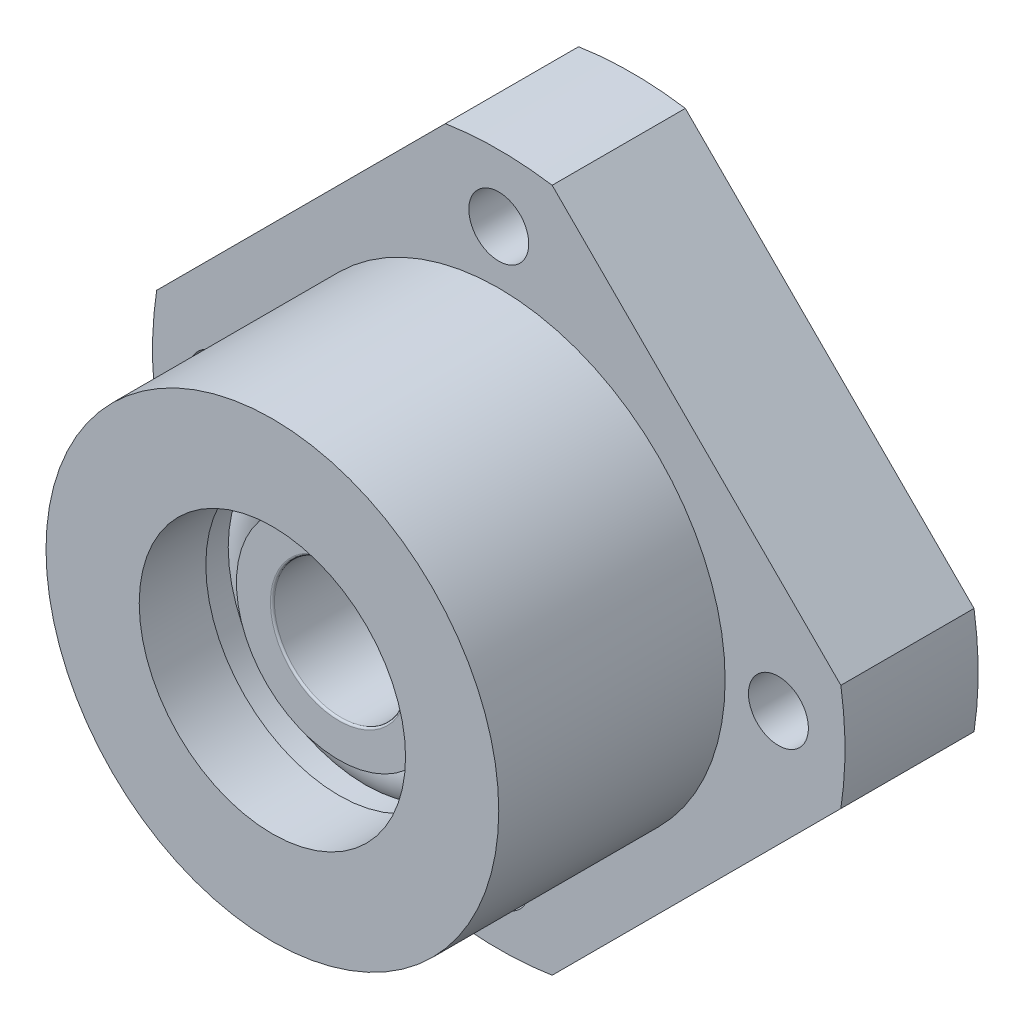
ISO-10303-21;
HEADER;
FILE_DESCRIPTION(('STEP AP214'),'2;1');
FILE_NAME('part.step','',(''),(''),'','','');
FILE_SCHEMA(('AUTOMOTIVE_DESIGN { 1 0 10303 214 1 1 1 1 }'));
ENDSEC;
DATA;
#1=APPLICATION_CONTEXT('core data for automotive mechanical design processes');
#2=APPLICATION_PROTOCOL_DEFINITION('international standard','automotive_design',2000,#1);
#3=PRODUCT_CONTEXT('',#1,'mechanical');
#4=PRODUCT('Part','Part','',(#3));
#5=PRODUCT_RELATED_PRODUCT_CATEGORY('part','',(#4));
#6=PRODUCT_DEFINITION_FORMATION('','',#4);
#7=PRODUCT_DEFINITION_CONTEXT('part definition',#1,'design');
#8=PRODUCT_DEFINITION('design','',#6,#7);
#9=PRODUCT_DEFINITION_SHAPE('','',#8);
#10=(LENGTH_UNIT() NAMED_UNIT(*) SI_UNIT(.MILLI.,.METRE.));
#11=(NAMED_UNIT(*) PLANE_ANGLE_UNIT() SI_UNIT($,.RADIAN.));
#12=(NAMED_UNIT(*) SI_UNIT($,.STERADIAN.) SOLID_ANGLE_UNIT());
#13=UNCERTAINTY_MEASURE_WITH_UNIT(LENGTH_MEASURE(1.E-05),#10,'distance_accuracy_value','');
#14=(GEOMETRIC_REPRESENTATION_CONTEXT(3) GLOBAL_UNCERTAINTY_ASSIGNED_CONTEXT((#13)) GLOBAL_UNIT_ASSIGNED_CONTEXT((#10,
#11,#12)) REPRESENTATION_CONTEXT('',''));
#15=CARTESIAN_POINT('',(0.,0.,0.));
#16=DIRECTION('',(0.,0.,1.));
#17=DIRECTION('',(1.,0.,0.));
#18=AXIS2_PLACEMENT_3D('',#15,#16,#17);
#19=CARTESIAN_POINT('',(0.,0.,-3.85));
#20=DIRECTION('',(0.,0.,-1.));
#21=DIRECTION('',(-1.,0.,0.));
#22=AXIS2_PLACEMENT_3D('',#19,#20,#21);
#23=TOROIDAL_SURFACE('',#22,5.14999999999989,0.15);
#24=CARTESIAN_POINT('',(0.,0.,-3.85));
#25=DIRECTION('',(0.,0.,1.));
#26=DIRECTION('',(1.,0.,0.));
#27=AXIS2_PLACEMENT_3D('',#24,#25,#26);
#28=CIRCLE('',#27,4.99999999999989);
#29=CARTESIAN_POINT('',(4.99999999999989,0.,-3.85));
#30=VERTEX_POINT('',#29);
#31=EDGE_CURVE('E217',#30,#30,#28,.T.);
#32=ORIENTED_EDGE('',*,*,#31,.T.);
#33=EDGE_LOOP('',(#32));
#34=FACE_BOUND('',#33,.T.);
#35=CARTESIAN_POINT('',(0.,0.,-4.));
#36=DIRECTION('',(0.,0.,-1.));
#37=DIRECTION('',(-1.,0.,0.));
#38=AXIS2_PLACEMENT_3D('',#35,#36,#37);
#39=CIRCLE('',#38,5.14999999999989);
#40=CARTESIAN_POINT('',(-5.14999999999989,0.,-4.));
#41=VERTEX_POINT('',#40);
#42=EDGE_CURVE('E220',#41,#41,#39,.F.);
#43=ORIENTED_EDGE('',*,*,#42,.F.);
#44=EDGE_LOOP('',(#43));
#45=FACE_BOUND('',#44,.T.);
#46=ADVANCED_FACE('F17',(#34,#45),#23,.T.);
#47=CARTESIAN_POINT('',(0.,13.,-4.));
#48=DIRECTION('',(0.,0.,1.));
#49=DIRECTION('',(1.,0.,0.));
#50=AXIS2_PLACEMENT_3D('',#47,#48,#49);
#51=PLANE('',#50);
#52=ORIENTED_EDGE('',*,*,#42,.T.);
#53=EDGE_LOOP('',(#52));
#54=FACE_BOUND('',#53,.T.);
#55=CARTESIAN_POINT('',(0.,0.,-4.));
#56=DIRECTION('',(0.,0.,1.));
#57=DIRECTION('',(1.,0.,0.));
#58=AXIS2_PLACEMENT_3D('',#55,#56,#57);
#59=CIRCLE('',#58,5.);
#60=CARTESIAN_POINT('',(5.,0.,-4.));
#61=VERTEX_POINT('',#60);
#62=EDGE_CURVE('E214',#61,#61,#59,.F.);
#63=ORIENTED_EDGE('',*,*,#62,.T.);
#64=EDGE_LOOP('',(#63));
#65=FACE_BOUND('',#64,.T.);
#66=ADVANCED_FACE('F231',(#54,#65),#51,.T.);
#67=CARTESIAN_POINT('',(0.,0.,-50.));
#68=DIRECTION('',(0.,0.,1.));
#69=DIRECTION('',(1.,0.,0.));
#70=AXIS2_PLACEMENT_3D('',#67,#68,#69);
#71=CYLINDRICAL_SURFACE('',#70,4.99999999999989);
#72=CARTESIAN_POINT('',(0.,0.,3.7));
#73=DIRECTION('',(0.,0.,-1.));
#74=DIRECTION('',(-1.,0.,0.));
#75=AXIS2_PLACEMENT_3D('',#72,#73,#74);
#76=CIRCLE('',#75,4.99999999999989);
#77=CARTESIAN_POINT('',(-4.99999999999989,0.,3.7));
#78=VERTEX_POINT('',#77);
#79=EDGE_CURVE('E210',#78,#78,#76,.T.);
#80=ORIENTED_EDGE('',*,*,#79,.F.);
#81=EDGE_LOOP('',(#80));
#82=FACE_BOUND('',#81,.T.);
#83=ORIENTED_EDGE('',*,*,#31,.F.);
#84=EDGE_LOOP('',(#83));
#85=FACE_BOUND('',#84,.T.);
#86=ADVANCED_FACE('F240',(#82,#85),#71,.F.);
#87=CARTESIAN_POINT('',(-4.76969600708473,0.,-15.15));
#88=DIRECTION('',(-1.,0.,0.));
#89=DIRECTION('',(0.,0.,1.));
#90=AXIS2_PLACEMENT_3D('',#87,#88,#89);
#91=PLANE('',#90);
#92=CARTESIAN_POINT('',(-4.76969600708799,0.,-13.65));
#93=DIRECTION('',(1.,0.,0.));
#94=DIRECTION('',(0.,0.,-1.));
#95=AXIS2_PLACEMENT_3D('',#92,#93,#94);
#96=CIRCLE('',#95,1.50000000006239);
#97=CARTESIAN_POINT('',(-4.76969600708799,0.,-15.1500000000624));
#98=VERTEX_POINT('',#97);
#99=EDGE_CURVE('E213',#98,#98,#96,.F.);
#100=ORIENTED_EDGE('',*,*,#99,.T.);
#101=EDGE_LOOP('',(#100));
#102=FACE_BOUND('',#101,.T.);
#103=ADVANCED_FACE('F243',(#102),#91,.T.);
#104=CARTESIAN_POINT('',(1.5,4.76969600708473,-13.65));
#105=DIRECTION('',(0.,1.,0.));
#106=DIRECTION('',(0.,0.,1.));
#107=AXIS2_PLACEMENT_3D('',#104,#105,#106);
#108=PLANE('',#107);
#109=CARTESIAN_POINT('',(0.,4.76969600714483,-13.65));
#110=DIRECTION('',(0.,-1.,0.));
#111=DIRECTION('',(0.,0.,-1.));
#112=AXIS2_PLACEMENT_3D('',#109,#110,#111);
#113=CIRCLE('',#112,1.50000000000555);
#114=CARTESIAN_POINT('',(0.,4.76969600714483,-15.1500000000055));
#115=VERTEX_POINT('',#114);
#116=EDGE_CURVE('E539',#115,#115,#113,.F.);
#117=ORIENTED_EDGE('',*,*,#116,.T.);
#118=EDGE_LOOP('',(#117));
#119=FACE_BOUND('',#118,.T.);
#120=ADVANCED_FACE('F246',(#119),#108,.T.);
#121=CARTESIAN_POINT('',(0.,0.,-17.5));
#122=DIRECTION('',(0.,0.,1.));
#123=DIRECTION('',(1.,0.,0.));
#124=AXIS2_PLACEMENT_3D('',#121,#122,#123);
#125=CYLINDRICAL_SURFACE('',#124,5.);
#126=ORIENTED_EDGE('',*,*,#62,.F.);
#127=EDGE_LOOP('',(#126));
#128=FACE_BOUND('',#127,.T.);
#129=CARTESIAN_POINT('',(0.,0.,-10.2));
#130=DIRECTION('',(0.,0.,1.));
#131=DIRECTION('',(1.,0.,0.));
#132=AXIS2_PLACEMENT_3D('',#129,#130,#131);
#133=CIRCLE('',#132,5.);
#134=CARTESIAN_POINT('',(5.,0.,-10.2));
#135=VERTEX_POINT('',#134);
#136=EDGE_CURVE('E541',#135,#135,#133,.T.);
#137=ORIENTED_EDGE('',*,*,#136,.F.);
#138=EDGE_LOOP('',(#137));
#139=FACE_BOUND('',#138,.T.);
#140=ADVANCED_FACE('F204',(#128,#139),#125,.F.);
#141=CARTESIAN_POINT('',(0.,0.,3.7));
#142=DIRECTION('',(0.,0.,-1.));
#143=DIRECTION('',(-1.,0.,0.));
#144=AXIS2_PLACEMENT_3D('',#141,#142,#143);
#145=TOROIDAL_SURFACE('',#144,5.29999999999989,0.3);
#146=CARTESIAN_POINT('',(0.,0.,4.));
#147=DIRECTION('',(0.,0.,-1.));
#148=DIRECTION('',(-1.,0.,0.));
#149=AXIS2_PLACEMENT_3D('',#146,#147,#148);
#150=CIRCLE('',#149,5.29999999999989);
#151=CARTESIAN_POINT('',(-5.29999999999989,0.,4.));
#152=VERTEX_POINT('',#151);
#153=EDGE_CURVE('E174',#152,#152,#150,.T.);
#154=ORIENTED_EDGE('',*,*,#153,.F.);
#155=EDGE_LOOP('',(#154));
#156=FACE_BOUND('',#155,.T.);
#157=ORIENTED_EDGE('',*,*,#79,.T.);
#158=EDGE_LOOP('',(#157));
#159=FACE_BOUND('',#158,.T.);
#160=ADVANCED_FACE('F199',(#156,#159),#145,.T.);
#161=CARTESIAN_POINT('',(-4.76969600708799,0.,-13.65));
#162=DIRECTION('',(1.,0.,0.));
#163=DIRECTION('',(0.,0.,-1.));
#164=AXIS2_PLACEMENT_3D('',#161,#162,#163);
#165=CONICAL_SURFACE('',#164,1.50000000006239,0.785398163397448);
#166=CARTESIAN_POINT('',(-5.04019600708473,0.,-13.65));
#167=DIRECTION('',(-1.,0.,0.));
#168=DIRECTION('',(0.,0.,1.));
#169=AXIS2_PLACEMENT_3D('',#166,#167,#168);
#170=CIRCLE('',#169,1.2295);
#171=CARTESIAN_POINT('',(-5.04019600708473,0.,-12.4205));
#172=VERTEX_POINT('',#171);
#173=EDGE_CURVE('E169',#172,#172,#170,.T.);
#174=ORIENTED_EDGE('',*,*,#173,.T.);
#175=EDGE_LOOP('',(#174));
#176=FACE_BOUND('',#175,.T.);
#177=ORIENTED_EDGE('',*,*,#99,.F.);
#178=EDGE_LOOP('',(#177));
#179=FACE_BOUND('',#178,.T.);
#180=ADVANCED_FACE('F195',(#176,#179),#165,.F.);
#181=CARTESIAN_POINT('',(0.,4.76969600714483,-13.65));
#182=DIRECTION('',(0.,-1.,0.));
#183=DIRECTION('',(0.,0.,-1.));
#184=AXIS2_PLACEMENT_3D('',#181,#182,#183);
#185=CONICAL_SURFACE('',#184,1.50000000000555,0.785398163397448);
#186=CARTESIAN_POINT('',(0.,5.04019600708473,-13.65));
#187=DIRECTION('',(0.,1.,0.));
#188=DIRECTION('',(0.,0.,1.));
#189=AXIS2_PLACEMENT_3D('',#186,#187,#188);
#190=CIRCLE('',#189,1.2295);
#191=CARTESIAN_POINT('',(0.,5.04019600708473,-12.4205));
#192=VERTEX_POINT('',#191);
#193=EDGE_CURVE('E166',#192,#192,#190,.T.);
#194=ORIENTED_EDGE('',*,*,#193,.T.);
#195=EDGE_LOOP('',(#194));
#196=FACE_BOUND('',#195,.T.);
#197=ORIENTED_EDGE('',*,*,#116,.F.);
#198=EDGE_LOOP('',(#197));
#199=FACE_BOUND('',#198,.T.);
#200=ADVANCED_FACE('F191',(#196,#199),#185,.F.);
#201=CARTESIAN_POINT('',(0.,5.,-10.2));
#202=DIRECTION('',(0.,0.,1.));
#203=DIRECTION('',(1.,0.,0.));
#204=AXIS2_PLACEMENT_3D('',#201,#202,#203);
#205=PLANE('',#204);
#206=ORIENTED_EDGE('',*,*,#136,.T.);
#207=EDGE_LOOP('',(#206));
#208=FACE_BOUND('',#207,.T.);
#209=CARTESIAN_POINT('',(0.,0.,-10.2));
#210=DIRECTION('',(0.,0.,1.));
#211=DIRECTION('',(1.,0.,0.));
#212=AXIS2_PLACEMENT_3D('',#209,#210,#211);
#213=CIRCLE('',#212,4.4585);
#214=CARTESIAN_POINT('',(4.4585,0.,-10.2));
#215=VERTEX_POINT('',#214);
#216=EDGE_CURVE('E163',#215,#215,#213,.F.);
#217=ORIENTED_EDGE('',*,*,#216,.T.);
#218=EDGE_LOOP('',(#217));
#219=FACE_BOUND('',#218,.T.);
#220=ADVANCED_FACE('F186',(#208,#219),#205,.T.);
#221=CARTESIAN_POINT('',(0.,0.,4.3));
#222=DIRECTION('',(0.,0.,-1.));
#223=DIRECTION('',(-1.,0.,0.));
#224=AXIS2_PLACEMENT_3D('',#221,#222,#223);
#225=TOROIDAL_SURFACE('',#224,5.29999999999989,0.3);
#226=CARTESIAN_POINT('',(0.,0.,4.3));
#227=DIRECTION('',(0.,0.,1.));
#228=DIRECTION('',(1.,0.,0.));
#229=AXIS2_PLACEMENT_3D('',#226,#227,#228);
#230=CIRCLE('',#229,4.99999999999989);
#231=CARTESIAN_POINT('',(4.99999999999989,0.,4.3));
#232=VERTEX_POINT('',#231);
#233=EDGE_CURVE('E159',#232,#232,#230,.T.);
#234=ORIENTED_EDGE('',*,*,#233,.T.);
#235=EDGE_LOOP('',(#234));
#236=FACE_BOUND('',#235,.T.);
#237=ORIENTED_EDGE('',*,*,#153,.T.);
#238=EDGE_LOOP('',(#237));
#239=FACE_BOUND('',#238,.T.);
#240=ADVANCED_FACE('F181',(#236,#239),#225,.T.);
#241=CARTESIAN_POINT('',(-4.76969600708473,0.,-13.65));
#242=DIRECTION('',(-1.,0.,0.));
#243=DIRECTION('',(0.,0.,1.));
#244=AXIS2_PLACEMENT_3D('',#241,#242,#243);
#245=CYLINDRICAL_SURFACE('',#244,1.2295);
#246=CARTESIAN_POINT('',(-9.2295000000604,0.,-13.65));
#247=DIRECTION('',(-1.,0.,0.));
#248=DIRECTION('',(0.,0.,1.));
#249=AXIS2_PLACEMENT_3D('',#246,#247,#248);
#250=CIRCLE('',#249,1.22949999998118);
#251=CARTESIAN_POINT('',(-9.2295000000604,0.,-12.4205000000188));
#252=VERTEX_POINT('',#251);
#253=EDGE_CURVE('E162',#252,#252,#250,.T.);
#254=ORIENTED_EDGE('',*,*,#253,.T.);
#255=EDGE_LOOP('',(#254));
#256=FACE_BOUND('',#255,.T.);
#257=ORIENTED_EDGE('',*,*,#173,.F.);
#258=EDGE_LOOP('',(#257));
#259=FACE_BOUND('',#258,.T.);
#260=ADVANCED_FACE('F185',(#256,#259),#245,.F.);
#261=CARTESIAN_POINT('',(0.,4.76969600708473,-13.65));
#262=DIRECTION('',(0.,1.,0.));
#263=DIRECTION('',(0.,0.,1.));
#264=AXIS2_PLACEMENT_3D('',#261,#262,#263);
#265=CYLINDRICAL_SURFACE('',#264,1.2295);
#266=CARTESIAN_POINT('',(0.,9.2295000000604,-13.65));
#267=DIRECTION('',(0.,1.,0.));
#268=DIRECTION('',(0.,0.,1.));
#269=AXIS2_PLACEMENT_3D('',#266,#267,#268);
#270=CIRCLE('',#269,1.22949999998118);
#271=CARTESIAN_POINT('',(0.,9.2295000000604,-12.4205000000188));
#272=VERTEX_POINT('',#271);
#273=EDGE_CURVE('E520',#272,#272,#270,.T.);
#274=ORIENTED_EDGE('',*,*,#273,.T.);
#275=EDGE_LOOP('',(#274));
#276=FACE_BOUND('',#275,.T.);
#277=ORIENTED_EDGE('',*,*,#193,.F.);
#278=EDGE_LOOP('',(#277));
#279=FACE_BOUND('',#278,.T.);
#280=ADVANCED_FACE('F534',(#276,#279),#265,.F.);
#281=CARTESIAN_POINT('',(0.,0.,-18.3));
#282=DIRECTION('',(0.,0.,1.));
#283=DIRECTION('',(1.,0.,0.));
#284=AXIS2_PLACEMENT_3D('',#281,#282,#283);
#285=CYLINDRICAL_SURFACE('',#284,4.4585);
#286=ORIENTED_EDGE('',*,*,#216,.F.);
#287=EDGE_LOOP('',(#286));
#288=FACE_BOUND('',#287,.T.);
#289=CARTESIAN_POINT('',(0.,0.,-17.3));
#290=DIRECTION('',(0.,0.,1.));
#291=DIRECTION('',(1.,0.,0.));
#292=AXIS2_PLACEMENT_3D('',#289,#290,#291);
#293=CIRCLE('',#292,4.4585);
#294=CARTESIAN_POINT('',(4.4585,0.,-17.3));
#295=VERTEX_POINT('',#294);
#296=EDGE_CURVE('E507',#295,#295,#293,.F.);
#297=ORIENTED_EDGE('',*,*,#296,.T.);
#298=EDGE_LOOP('',(#297));
#299=FACE_BOUND('',#298,.T.);
#300=ADVANCED_FACE('F1019',(#288,#299),#285,.F.);
#301=CARTESIAN_POINT('',(0.,0.,-50.));
#302=DIRECTION('',(0.,0.,1.));
#303=DIRECTION('',(1.,0.,0.));
#304=AXIS2_PLACEMENT_3D('',#301,#302,#303);
#305=CYLINDRICAL_SURFACE('',#304,4.99999999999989);
#306=CARTESIAN_POINT('',(0.,0.,11.85));
#307=DIRECTION('',(0.,0.,-1.));
#308=DIRECTION('',(-1.,0.,0.));
#309=AXIS2_PLACEMENT_3D('',#306,#307,#308);
#310=CIRCLE('',#309,4.99999999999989);
#311=CARTESIAN_POINT('',(-4.99999999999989,0.,11.85));
#312=VERTEX_POINT('',#311);
#313=EDGE_CURVE('E140',#312,#312,#310,.T.);
#314=ORIENTED_EDGE('',*,*,#313,.F.);
#315=EDGE_LOOP('',(#314));
#316=FACE_BOUND('',#315,.T.);
#317=ORIENTED_EDGE('',*,*,#233,.F.);
#318=EDGE_LOOP('',(#317));
#319=FACE_BOUND('',#318,.T.);
#320=ADVANCED_FACE('F468',(#316,#319),#305,.F.);
#321=CARTESIAN_POINT('',(-9.5023004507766,0.,-13.65));
#322=DIRECTION('',(-1.,0.,0.));
#323=DIRECTION('',(0.,0.,1.));
#324=AXIS2_PLACEMENT_3D('',#321,#322,#323);
#325=CONICAL_SURFACE('',#324,1.50230045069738,0.785398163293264);
#326=CARTESIAN_POINT('',(-9.45561102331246,-0.917289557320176,-14.7802138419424));
#327=CARTESIAN_POINT('',(-9.46070863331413,-0.86473928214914,-14.8294293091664));
#328=CARTESIAN_POINT('',(-9.46572402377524,-0.808473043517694,-14.8746974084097));
#329=CARTESIAN_POINT('',(-9.47512942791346,-0.689549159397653,-14.9560235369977));
#330=CARTESIAN_POINT('',(-9.47951926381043,-0.626889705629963,-14.992078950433));
#331=CARTESIAN_POINT('',(-9.48758183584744,-0.49074493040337,-15.0564882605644));
#332=CARTESIAN_POINT('',(-9.49115653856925,-0.416792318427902,-15.0838764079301));
#333=CARTESIAN_POINT('',(-9.49660257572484,-0.265119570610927,-15.1250238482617));
#334=CARTESIAN_POINT('',(-9.49847417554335,-0.187400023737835,-15.1387852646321));
#335=CARTESIAN_POINT('',(-9.50021820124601,-0.0355584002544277,-15.1516107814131));
#336=CARTESIAN_POINT('',(-9.50020638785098,0.0384913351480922,-15.1515259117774));
#337=CARTESIAN_POINT('',(-9.49847364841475,0.185465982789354,-15.1387792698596));
#338=CARTESIAN_POINT('',(-9.49675303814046,0.25839110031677,-15.1261198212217));
#339=CARTESIAN_POINT('',(-9.49184616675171,0.399713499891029,-15.0891203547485));
#340=CARTESIAN_POINT('',(-9.4886873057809,0.468169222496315,-15.064998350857));
#341=CARTESIAN_POINT('',(-9.48124860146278,0.600255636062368,-15.0061002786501));
#342=CARTESIAN_POINT('',(-9.47696858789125,0.663885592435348,-14.9713225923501));
#343=CARTESIAN_POINT('',(-9.46752796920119,0.78734029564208,-14.8907101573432));
#344=CARTESIAN_POINT('',(-9.46233880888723,0.846908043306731,-14.8444860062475));
#345=CARTESIAN_POINT('',(-9.45173326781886,0.958051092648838,-14.7432942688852));
#346=CARTESIAN_POINT('',(-9.44631682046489,1.00962403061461,-14.6883241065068));
#347=CARTESIAN_POINT('',(-9.43539869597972,1.10717333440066,-14.5670481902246));
#348=CARTESIAN_POINT('',(-9.42991797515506,1.15249797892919,-14.5002162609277));
#349=CARTESIAN_POINT('',(-9.41984967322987,1.23208995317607,-14.3602054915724));
#350=CARTESIAN_POINT('',(-9.4152623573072,1.26635400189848,-14.2870247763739));
#351=CARTESIAN_POINT('',(-9.40719070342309,1.32502880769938,-14.1314569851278));
#352=CARTESIAN_POINT('',(-9.40379373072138,1.34868559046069,-14.0487803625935));
#353=CARTESIAN_POINT('',(-9.3988951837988,1.38241118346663,-13.8806444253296));
#354=CARTESIAN_POINT('',(-9.39739397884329,1.39247734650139,-13.7951845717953));
#355=CARTESIAN_POINT('',(-9.396434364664,1.3989410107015,-13.6208687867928));
#356=CARTESIAN_POINT('',(-9.39704584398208,1.39487085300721,-13.5319947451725));
#357=CARTESIAN_POINT('',(-9.40039841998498,1.37209303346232,-13.3561736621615));
#358=CARTESIAN_POINT('',(-9.40313973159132,1.35338389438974,-13.269226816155));
#359=CARTESIAN_POINT('',(-9.41044954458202,1.30158475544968,-13.0994159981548));
#360=CARTESIAN_POINT('',(-9.41502527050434,1.26843784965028,-13.0165696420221));
#361=CARTESIAN_POINT('',(-9.42546007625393,1.18841214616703,-12.8578620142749));
#362=CARTESIAN_POINT('',(-9.43131911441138,1.14153379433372,-12.7820005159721));
#363=CARTESIAN_POINT('',(-9.4434365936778,1.03644676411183,-12.6416662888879));
#364=CARTESIAN_POINT('',(-9.44968072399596,0.978563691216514,-12.5769490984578));
#365=CARTESIAN_POINT('',(-9.4619222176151,0.85208488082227,-12.4589489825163));
#366=CARTESIAN_POINT('',(-9.46791967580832,0.783493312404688,-12.4056616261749));
#367=CARTESIAN_POINT('',(-9.47853266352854,0.641976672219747,-12.3156479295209));
#368=CARTESIAN_POINT('',(-9.48321041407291,0.569575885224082,-12.2781059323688));
#369=CARTESIAN_POINT('',(-9.49104923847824,0.419095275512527,-12.216764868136));
#370=CARTESIAN_POINT('',(-9.49421118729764,0.341018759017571,-12.1929578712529));
#371=CARTESIAN_POINT('',(-9.49843210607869,0.18769201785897,-12.1614666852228));
#372=CARTESIAN_POINT('',(-9.49963008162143,0.112663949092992,-12.1527143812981));
#373=CARTESIAN_POINT('',(-9.50022231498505,-0.0377712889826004,-12.1483682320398));
#374=CARTESIAN_POINT('',(-9.49961704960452,-0.113178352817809,-12.152770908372));
#375=CARTESIAN_POINT('',(-9.49673408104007,-0.25918065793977,-12.1741032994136));
#376=CARTESIAN_POINT('',(-9.49452157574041,-0.329849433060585,-12.1905448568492));
#377=CARTESIAN_POINT('',(-9.48874059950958,-0.467494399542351,-12.2347210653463));
#378=CARTESIAN_POINT('',(-9.4851720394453,-0.534470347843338,-12.2624564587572));
#379=CARTESIAN_POINT('',(-9.47695753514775,-0.664547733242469,-12.3289332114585));
#380=CARTESIAN_POINT('',(-9.47228910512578,-0.727527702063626,-12.3679087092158));
#381=CARTESIAN_POINT('',(-9.4623968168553,-0.846533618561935,-12.4552561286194));
#382=CARTESIAN_POINT('',(-9.45717281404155,-0.902557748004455,-12.5036304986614));
#383=CARTESIAN_POINT('',(-9.44632691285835,-1.00995635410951,-12.6117361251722));
#384=CARTESIAN_POINT('',(-9.44070118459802,-1.06079352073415,-12.6720005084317));
#385=CARTESIAN_POINT('',(-9.4299564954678,-1.15241201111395,-12.7997771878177));
#386=CARTESIAN_POINT('',(-9.42483769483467,-1.19319016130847,-12.8672917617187));
#387=CARTESIAN_POINT('',(-9.4152848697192,-1.26644166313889,-13.0126602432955));
#388=CARTESIAN_POINT('',(-9.41092249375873,-1.29814755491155,-13.0909061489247));
#389=CARTESIAN_POINT('',(-9.40381177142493,-1.34869481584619,-13.2515164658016));
#390=CARTESIAN_POINT('',(-9.4010637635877,-1.36753348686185,-13.3338817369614));
#391=CARTESIAN_POINT('',(-9.39739206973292,-1.39254967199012,-13.5042639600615));
#392=CARTESIAN_POINT('',(-9.39655382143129,-1.39813468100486,-13.5923702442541));
#393=CARTESIAN_POINT('',(-9.3970480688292,-1.39480785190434,-13.7683218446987));
#394=CARTESIAN_POINT('',(-9.39838113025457,-1.38589223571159,-13.8561670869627));
#395=CARTESIAN_POINT('',(-9.40309929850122,-1.35351166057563,-14.0303142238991));
#396=CARTESIAN_POINT('',(-9.40651189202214,-1.32985171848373,-14.1165792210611));
#397=CARTESIAN_POINT('',(-9.41501132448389,-1.26827526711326,-14.2837522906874));
#398=CARTESIAN_POINT('',(-9.42009717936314,-1.23036713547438,-14.3646634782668));
#399=CARTESIAN_POINT('',(-9.43027365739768,-1.1494635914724,-14.5041867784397));
#400=CARTESIAN_POINT('',(-9.43518586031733,-1.10874188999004,-14.5641407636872));
#401=CARTESIAN_POINT('',(-9.44529674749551,-1.01902137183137,-14.6774574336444));
#402=CARTESIAN_POINT('',(-9.45049528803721,-0.970026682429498,-14.7308233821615));
#403=CARTESIAN_POINT('',(-9.45561102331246,-0.917289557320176,-14.7802138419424));
#404=B_SPLINE_CURVE_WITH_KNOTS('',3,(#326,#327,#328,#329,#330,#331,#332,#333,#334,#335,#336,
#337,#338,#339,#340,#341,#342,#343,#344,#345,#346,#347,#348,#349,#350,#351,#352,#353,#354,#355,
#356,#357,#358,#359,#360,#361,#362,#363,#364,#365,#366,#367,#368,#369,#370,#371,#372,#373,#374,
#375,#376,#377,#378,#379,#380,#381,#382,#383,#384,#385,#386,#387,#388,#389,#390,#391,#392,#393,
#394,#395,#396,#397,#398,#399,#400,#401,#402,#403),.UNSPECIFIED.,.T.,.F.,(4,2,2,2,2,2,2,2,2,2,2,
2,2,2,2,2,2,2,2,2,2,2,2,2,2,2,2,2,2,2,2,2,2,2,2,2,2,2,4),(0.,0.216326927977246,
0.432715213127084,0.668281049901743,0.9038101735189,1.12486885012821,1.34588668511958,
1.562859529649,1.77986533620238,2.00562396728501,2.23144921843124,2.47320975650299,
2.71504194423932,2.97206214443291,3.2291324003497,3.49478694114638,3.76046829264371,
4.02720642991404,4.29393590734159,4.55374345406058,4.81345010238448,5.05721849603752,
5.30084601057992,5.52634070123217,5.75177577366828,5.96854315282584,6.18532478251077,
6.40699611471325,6.6287252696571,6.8648367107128,7.10102254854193,7.35351002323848,
7.6060504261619,7.86968395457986,8.13338618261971,8.40065192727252,8.66776077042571,
8.88496492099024,9.10206102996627),.UNSPECIFIED.);
#405=CARTESIAN_POINT('',(-9.45561102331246,-0.917289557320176,-14.7802138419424));
#406=VERTEX_POINT('',#405);
#407=EDGE_CURVE('E471',#406,#406,#404,.T.);
#408=ORIENTED_EDGE('',*,*,#407,.F.);
#409=EDGE_LOOP('',(#408));
#410=FACE_BOUND('',#409,.T.);
#411=ORIENTED_EDGE('',*,*,#253,.F.);
#412=EDGE_LOOP('',(#411));
#413=FACE_BOUND('',#412,.T.);
#414=ADVANCED_FACE('F462',(#410,#413),#325,.F.);
#415=CARTESIAN_POINT('',(0.,9.5023004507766,-13.65));
#416=DIRECTION('',(0.,1.,0.));
#417=DIRECTION('',(0.,0.,1.));
#418=AXIS2_PLACEMENT_3D('',#415,#416,#417);
#419=CONICAL_SURFACE('',#418,1.50230045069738,0.785398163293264);
#420=CARTESIAN_POINT('',(-0.917289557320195,9.45561102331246,-14.7802138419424));
#421=CARTESIAN_POINT('',(-0.864739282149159,9.46070863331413,-14.8294293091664));
#422=CARTESIAN_POINT('',(-0.808473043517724,9.46572402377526,-14.8746974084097));
#423=CARTESIAN_POINT('',(-0.689549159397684,9.47512942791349,-14.9560235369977));
#424=CARTESIAN_POINT('',(-0.626889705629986,9.47951926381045,-14.992078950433));
#425=CARTESIAN_POINT('',(-0.49074493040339,9.48758183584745,-15.0564882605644));
#426=CARTESIAN_POINT('',(-0.416792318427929,9.49115653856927,-15.0838764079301));
#427=CARTESIAN_POINT('',(-0.265119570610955,9.49660257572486,-15.1250238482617));
#428=CARTESIAN_POINT('',(-0.187400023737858,9.49847417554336,-15.1387852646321));
#429=CARTESIAN_POINT('',(-0.0355584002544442,9.50021820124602,-15.1516107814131));
#430=CARTESIAN_POINT('',(0.0384913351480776,9.50020638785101,-15.1515259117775));
#431=CARTESIAN_POINT('',(0.185465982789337,9.49847364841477,-15.1387792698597));
#432=CARTESIAN_POINT('',(0.258391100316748,9.49675303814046,-15.1261198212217));
#433=CARTESIAN_POINT('',(0.399713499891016,9.49184616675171,-15.0891203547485));
#434=CARTESIAN_POINT('',(0.468169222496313,9.48868730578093,-15.064998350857));
#435=CARTESIAN_POINT('',(0.600255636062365,9.4812486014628,-15.0061002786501));
#436=CARTESIAN_POINT('',(0.663885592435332,9.47696858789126,-14.9713225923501));
#437=CARTESIAN_POINT('',(0.787340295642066,9.4675279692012,-14.8907101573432));
#438=CARTESIAN_POINT('',(0.846908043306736,9.46233880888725,-14.8444860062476));
#439=CARTESIAN_POINT('',(0.958051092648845,9.45173326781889,-14.7432942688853));
#440=CARTESIAN_POINT('',(1.0096240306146,9.4463168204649,-14.6883241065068));
#441=CARTESIAN_POINT('',(1.10717333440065,9.43539869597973,-14.5670481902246));
#442=CARTESIAN_POINT('',(1.1524979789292,9.42991797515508,-14.5002162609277));
#443=CARTESIAN_POINT('',(1.23208995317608,9.41984967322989,-14.3602054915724));
#444=CARTESIAN_POINT('',(1.26635400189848,9.4152623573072,-14.2870247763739));
#445=CARTESIAN_POINT('',(1.32502880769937,9.40719070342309,-14.1314569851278));
#446=CARTESIAN_POINT('',(1.34868559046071,9.4037937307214,-14.0487803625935));
#447=CARTESIAN_POINT('',(1.38241118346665,9.39889518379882,-13.8806444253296));
#448=CARTESIAN_POINT('',(1.39247734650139,9.39739397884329,-13.7951845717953));
#449=CARTESIAN_POINT('',(1.39894101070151,9.396434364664,-13.6208687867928));
#450=CARTESIAN_POINT('',(1.39487085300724,9.39704584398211,-13.5319947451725));
#451=CARTESIAN_POINT('',(1.37209303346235,9.40039841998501,-13.3561736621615));
#452=CARTESIAN_POINT('',(1.35338389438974,9.40313973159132,-13.269226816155));
#453=CARTESIAN_POINT('',(1.30158475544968,9.41044954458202,-13.0994159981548));
#454=CARTESIAN_POINT('',(1.26843784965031,9.41502527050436,-13.0165696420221));
#455=CARTESIAN_POINT('',(1.18841214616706,9.42546007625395,-12.8578620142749));
#456=CARTESIAN_POINT('',(1.14153379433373,9.43131911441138,-12.7820005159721));
#457=CARTESIAN_POINT('',(1.03644676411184,9.4434365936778,-12.6416662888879));
#458=CARTESIAN_POINT('',(0.97856369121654,9.44968072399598,-12.5769490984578));
#459=CARTESIAN_POINT('',(0.852084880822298,9.46192221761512,-12.4589489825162));
#460=CARTESIAN_POINT('',(0.783493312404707,9.46791967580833,-12.405661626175));
#461=CARTESIAN_POINT('',(0.641976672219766,9.47853266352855,-12.3156479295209));
#462=CARTESIAN_POINT('',(0.569575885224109,9.48321041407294,-12.2781059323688));
#463=CARTESIAN_POINT('',(0.419095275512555,9.49104923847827,-12.216764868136));
#464=CARTESIAN_POINT('',(0.341018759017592,9.49421118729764,-12.1929578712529));
#465=CARTESIAN_POINT('',(0.187692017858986,9.4984321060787,-12.1614666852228));
#466=CARTESIAN_POINT('',(0.11266394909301,9.49963008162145,-12.1527143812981));
#467=CARTESIAN_POINT('',(-0.0377712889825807,9.50022231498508,-12.1483682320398));
#468=CARTESIAN_POINT('',(-0.113178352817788,9.49961704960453,-12.152770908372));
#469=CARTESIAN_POINT('',(-0.259180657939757,9.49673408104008,-12.1741032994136));
#470=CARTESIAN_POINT('',(-0.32984943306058,9.49452157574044,-12.1905448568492));
#471=CARTESIAN_POINT('',(-0.467494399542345,9.48874059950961,-12.2347210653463));
#472=CARTESIAN_POINT('',(-0.534470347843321,9.48517203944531,-12.2624564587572));
#473=CARTESIAN_POINT('',(-0.664547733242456,9.47695753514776,-12.3289332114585));
#474=CARTESIAN_POINT('',(-0.727527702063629,9.4722891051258,-12.3679087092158));
#475=CARTESIAN_POINT('',(-0.84653361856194,9.46239681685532,-12.4552561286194));
#476=CARTESIAN_POINT('',(-0.902557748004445,9.45717281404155,-12.5036304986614));
#477=CARTESIAN_POINT('',(-1.0099563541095,9.44632691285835,-12.6117361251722));
#478=CARTESIAN_POINT('',(-1.06079352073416,9.44070118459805,-12.6720005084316));
#479=CARTESIAN_POINT('',(-1.15241201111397,9.42995649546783,-12.7997771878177));
#480=CARTESIAN_POINT('',(-1.19319016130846,9.42483769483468,-12.8672917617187));
#481=CARTESIAN_POINT('',(-1.26644166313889,9.41528486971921,-13.0126602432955));
#482=CARTESIAN_POINT('',(-1.29814755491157,9.41092249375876,-13.0909061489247));
#483=CARTESIAN_POINT('',(-1.34869481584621,9.40381177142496,-13.2515164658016));
#484=CARTESIAN_POINT('',(-1.36753348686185,9.4010637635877,-13.3338817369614));
#485=CARTESIAN_POINT('',(-1.39254967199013,9.39739206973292,-13.5042639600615));
#486=CARTESIAN_POINT('',(-1.39813468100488,9.39655382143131,-13.5923702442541));
#487=CARTESIAN_POINT('',(-1.39480785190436,9.39704806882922,-13.7683218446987));
#488=CARTESIAN_POINT('',(-1.3858922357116,9.39838113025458,-13.8561670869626));
#489=CARTESIAN_POINT('',(-1.35351166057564,9.40309929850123,-14.030314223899));
#490=CARTESIAN_POINT('',(-1.32985171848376,9.40651189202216,-14.1165792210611));
#491=CARTESIAN_POINT('',(-1.26827526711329,9.41501132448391,-14.2837522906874));
#492=CARTESIAN_POINT('',(-1.23036713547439,9.42009717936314,-14.3646634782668));
#493=CARTESIAN_POINT('',(-1.14946359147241,9.43027365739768,-14.5041867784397));
#494=CARTESIAN_POINT('',(-1.10874188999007,9.43518586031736,-14.5641407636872));
#495=CARTESIAN_POINT('',(-1.0190213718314,9.44529674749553,-14.6774574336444));
#496=CARTESIAN_POINT('',(-0.970026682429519,9.45049528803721,-14.7308233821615));
#497=CARTESIAN_POINT('',(-0.917289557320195,9.45561102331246,-14.7802138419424));
#498=B_SPLINE_CURVE_WITH_KNOTS('',3,(#420,#421,#422,#423,#424,#425,#426,#427,#428,#429,#430,
#431,#432,#433,#434,#435,#436,#437,#438,#439,#440,#441,#442,#443,#444,#445,#446,#447,#448,#449,
#450,#451,#452,#453,#454,#455,#456,#457,#458,#459,#460,#461,#462,#463,#464,#465,#466,#467,#468,
#469,#470,#471,#472,#473,#474,#475,#476,#477,#478,#479,#480,#481,#482,#483,#484,#485,#486,#487,
#488,#489,#490,#491,#492,#493,#494,#495,#496,#497),.UNSPECIFIED.,.T.,.F.,(4,2,2,2,2,2,2,2,2,2,2,
2,2,2,2,2,2,2,2,2,2,2,2,2,2,2,2,2,2,2,2,2,2,2,2,2,2,2,4),(0.,0.216326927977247,
0.432715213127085,0.668281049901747,0.903810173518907,1.12486885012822,1.3458866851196,
1.56285952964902,1.77986533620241,2.00562396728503,2.23144921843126,2.47320975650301,
2.71504194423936,2.97206214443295,3.22913240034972,3.49478694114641,3.76046829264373,
4.02720642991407,4.29393590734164,4.55374345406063,4.81345010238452,5.05721849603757,
5.30084601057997,5.52634070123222,5.75177577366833,5.96854315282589,6.18532478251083,
6.40699611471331,6.62872526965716,6.86483671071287,7.10102254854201,7.35351002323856,
7.60605042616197,7.86968395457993,8.13338618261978,8.40065192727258,8.66776077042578,
8.88496492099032,9.10206102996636),.UNSPECIFIED.);
#499=CARTESIAN_POINT('',(-0.917289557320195,9.45561102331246,-14.7802138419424));
#500=VERTEX_POINT('',#499);
#501=EDGE_CURVE('E445',#500,#500,#498,.T.);
#502=ORIENTED_EDGE('',*,*,#501,.F.);
#503=EDGE_LOOP('',(#502));
#504=FACE_BOUND('',#503,.T.);
#505=ORIENTED_EDGE('',*,*,#273,.F.);
#506=EDGE_LOOP('',(#505));
#507=FACE_BOUND('',#506,.T.);
#508=ADVANCED_FACE('F457',(#504,#507),#419,.F.);
#509=CARTESIAN_POINT('',(0.,0.,-17.3));
#510=DIRECTION('',(0.,0.,1.));
#511=DIRECTION('',(1.,0.,0.));
#512=AXIS2_PLACEMENT_3D('',#509,#510,#511);
#513=PLANE('',#512);
#514=ORIENTED_EDGE('',*,*,#296,.F.);
#515=EDGE_LOOP('',(#514));
#516=FACE_BOUND('',#515,.T.);
#517=CARTESIAN_POINT('',(0.,0.,-17.3));
#518=DIRECTION('',(0.,0.,1.));
#519=DIRECTION('',(1.,0.,0.));
#520=AXIS2_PLACEMENT_3D('',#517,#518,#519);
#521=CIRCLE('',#520,9.5);
#522=CARTESIAN_POINT('',(2.03401006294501,9.27969843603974,-17.3));
#523=VERTEX_POINT('',#522);
#524=CARTESIAN_POINT('',(-2.03401006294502,9.27969843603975,-17.3));
#525=VERTEX_POINT('',#524);
#526=EDGE_CURVE('E455',#523,#525,#521,.T.);
#527=ORIENTED_EDGE('',*,*,#526,.F.);
#528=DIRECTION('',(0.707106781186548,-0.707106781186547,0.));
#529=VECTOR('',#528,1.);
#530=CARTESIAN_POINT('',(9.27969843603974,2.03401006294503,-17.3));
#531=LINE('',#530,#529);
#532=CARTESIAN_POINT('',(9.27969843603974,2.03401006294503,-17.3));
#533=VERTEX_POINT('',#532);
#534=EDGE_CURVE('E137',#523,#533,#531,.T.);
#535=ORIENTED_EDGE('',*,*,#534,.T.);
#536=CARTESIAN_POINT('',(0.,0.,-17.3));
#537=DIRECTION('',(0.,0.,1.));
#538=DIRECTION('',(1.,0.,0.));
#539=AXIS2_PLACEMENT_3D('',#536,#537,#538);
#540=CIRCLE('',#539,9.5);
#541=CARTESIAN_POINT('',(9.27969843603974,-2.03401006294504,-17.3));
#542=VERTEX_POINT('',#541);
#543=EDGE_CURVE('E130',#542,#533,#540,.T.);
#544=ORIENTED_EDGE('',*,*,#543,.F.);
#545=DIRECTION('',(-0.707106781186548,-0.707106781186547,0.));
#546=VECTOR('',#545,1.);
#547=CARTESIAN_POINT('',(2.03401006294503,-9.27969843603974,-17.3));
#548=LINE('',#547,#546);
#549=CARTESIAN_POINT('',(2.03401006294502,-9.27969843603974,-17.3));
#550=VERTEX_POINT('',#549);
#551=EDGE_CURVE('E134',#542,#550,#548,.T.);
#552=ORIENTED_EDGE('',*,*,#551,.T.);
#553=CARTESIAN_POINT('',(0.,0.,-17.3));
#554=DIRECTION('',(0.,0.,1.));
#555=DIRECTION('',(1.,0.,0.));
#556=AXIS2_PLACEMENT_3D('',#553,#554,#555);
#557=CIRCLE('',#556,9.5);
#558=CARTESIAN_POINT('',(-2.03401006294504,-9.27969843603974,-17.3));
#559=VERTEX_POINT('',#558);
#560=EDGE_CURVE('E774',#559,#550,#557,.T.);
#561=ORIENTED_EDGE('',*,*,#560,.F.);
#562=DIRECTION('',(-0.707106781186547,0.707106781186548,0.));
#563=VECTOR('',#562,1.);
#564=CARTESIAN_POINT('',(-9.27969843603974,-2.03401006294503,-17.3));
#565=LINE('',#564,#563);
#566=CARTESIAN_POINT('',(-9.27969843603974,-2.03401006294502,-17.3));
#567=VERTEX_POINT('',#566);
#568=EDGE_CURVE('E157',#559,#567,#565,.T.);
#569=ORIENTED_EDGE('',*,*,#568,.T.);
#570=CARTESIAN_POINT('',(0.,0.,-17.3));
#571=DIRECTION('',(0.,0.,1.));
#572=DIRECTION('',(1.,0.,0.));
#573=AXIS2_PLACEMENT_3D('',#570,#571,#572);
#574=CIRCLE('',#573,9.5);
#575=CARTESIAN_POINT('',(-9.27969843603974,2.03401006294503,-17.3));
#576=VERTEX_POINT('',#575);
#577=EDGE_CURVE('E478',#576,#567,#574,.T.);
#578=ORIENTED_EDGE('',*,*,#577,.F.);
#579=DIRECTION('',(0.707106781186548,0.707106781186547,0.));
#580=VECTOR('',#579,1.);
#581=CARTESIAN_POINT('',(-2.03401006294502,9.27969843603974,-17.3));
#582=LINE('',#581,#580);
#583=EDGE_CURVE('E477',#576,#525,#582,.T.);
#584=ORIENTED_EDGE('',*,*,#583,.T.);
#585=EDGE_LOOP('',(#527,#535,#544,#552,#561,#569,#578,#584));
#586=FACE_BOUND('',#585,.T.);
#587=ADVANCED_FACE('F132',(#516,#586),#513,.F.);
#588=CARTESIAN_POINT('',(0.,0.,11.85));
#589=DIRECTION('',(0.,0.,-1.));
#590=DIRECTION('',(-1.,0.,0.));
#591=AXIS2_PLACEMENT_3D('',#588,#589,#590);
#592=TOROIDAL_SURFACE('',#591,5.14999999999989,0.15);
#593=CARTESIAN_POINT('',(0.,0.,12.));
#594=DIRECTION('',(0.,0.,1.));
#595=DIRECTION('',(-1.,0.,0.));
#596=AXIS2_PLACEMENT_3D('',#593,#594,#595);
#597=CIRCLE('',#596,5.14999999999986);
#598=CARTESIAN_POINT('',(-5.14999999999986,0.,12.));
#599=VERTEX_POINT('',#598);
#600=EDGE_CURVE('E414',#599,#599,#597,.F.);
#601=ORIENTED_EDGE('',*,*,#600,.F.);
#602=EDGE_LOOP('',(#601));
#603=FACE_BOUND('',#602,.T.);
#604=ORIENTED_EDGE('',*,*,#313,.T.);
#605=EDGE_LOOP('',(#604));
#606=FACE_BOUND('',#605,.T.);
#607=ADVANCED_FACE('F496',(#603,#606),#592,.T.);
#608=CARTESIAN_POINT('',(0.,0.,-10.));
#609=DIRECTION('',(0.,0.,1.));
#610=DIRECTION('',(1.,0.,0.));
#611=AXIS2_PLACEMENT_3D('',#608,#609,#610);
#612=CYLINDRICAL_SURFACE('',#611,9.5);
#613=DIRECTION('',(0.,0.,1.));
#614=VECTOR('',#613,1.);
#615=CARTESIAN_POINT('',(9.27969843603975,-2.03401006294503,-10.));
#616=LINE('',#615,#614);
#617=CARTESIAN_POINT('',(9.27969843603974,-2.03401006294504,-10.5));
#618=VERTEX_POINT('',#617);
#619=EDGE_CURVE('E143',#618,#542,#616,.F.);
#620=ORIENTED_EDGE('',*,*,#619,.T.);
#621=ORIENTED_EDGE('',*,*,#543,.T.);
#622=DIRECTION('',(0.,0.,1.));
#623=VECTOR('',#622,1.);
#624=CARTESIAN_POINT('',(9.27969843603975,2.03401006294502,-10.));
#625=LINE('',#624,#623);
#626=CARTESIAN_POINT('',(9.27969843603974,2.03401006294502,-10.5));
#627=VERTEX_POINT('',#626);
#628=EDGE_CURVE('E519',#533,#627,#625,.T.);
#629=ORIENTED_EDGE('',*,*,#628,.T.);
#630=CARTESIAN_POINT('',(0.,0.,-10.5));
#631=DIRECTION('',(0.,0.,1.));
#632=DIRECTION('',(1.,0.,0.));
#633=AXIS2_PLACEMENT_3D('',#630,#631,#632);
#634=CIRCLE('',#633,9.5);
#635=EDGE_CURVE('E146',#627,#618,#634,.F.);
#636=ORIENTED_EDGE('',*,*,#635,.T.);
#637=EDGE_LOOP('',(#620,#621,#629,#636));
#638=FACE_BOUND('',#637,.T.);
#639=ADVANCED_FACE('F144',(#638),#612,.T.);
#640=CARTESIAN_POINT('',(2.03401006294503,-9.27969843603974,-10.));
#641=DIRECTION('',(-0.707106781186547,0.707106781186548,0.));
#642=DIRECTION('',(-0.707106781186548,-0.707106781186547,0.));
#643=AXIS2_PLACEMENT_3D('',#640,#641,#642);
#644=PLANE('',#643);
#645=DIRECTION('',(-0.707106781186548,-0.707106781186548,0.));
#646=VECTOR('',#645,1.);
#647=CARTESIAN_POINT('',(9.27969843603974,-2.03401006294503,-10.5));
#648=LINE('',#647,#646);
#649=CARTESIAN_POINT('',(2.03401006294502,-9.27969843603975,-10.5));
#650=VERTEX_POINT('',#649);
#651=EDGE_CURVE('E408',#618,#650,#648,.T.);
#652=ORIENTED_EDGE('',*,*,#651,.T.);
#653=DIRECTION('',(0.,0.,1.));
#654=VECTOR('',#653,1.);
#655=CARTESIAN_POINT('',(2.03401006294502,-9.27969843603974,-10.));
#656=LINE('',#655,#654);
#657=EDGE_CURVE('E149',#550,#650,#656,.T.);
#658=ORIENTED_EDGE('',*,*,#657,.F.);
#659=ORIENTED_EDGE('',*,*,#551,.F.);
#660=ORIENTED_EDGE('',*,*,#619,.F.);
#661=EDGE_LOOP('',(#652,#658,#659,#660));
#662=FACE_BOUND('',#661,.T.);
#663=ADVANCED_FACE('F151',(#662),#644,.F.);
#664=CARTESIAN_POINT('',(0.,0.,-10.));
#665=DIRECTION('',(0.,0.,1.));
#666=DIRECTION('',(1.,0.,0.));
#667=AXIS2_PLACEMENT_3D('',#664,#665,#666);
#668=CYLINDRICAL_SURFACE('',#667,9.5);
#669=DIRECTION('',(0.,0.,1.));
#670=VECTOR('',#669,1.);
#671=CARTESIAN_POINT('',(-2.03401006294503,-9.27969843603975,-10.));
#672=LINE('',#671,#670);
#673=CARTESIAN_POINT('',(-2.03401006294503,-9.27969843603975,-10.5));
#674=VERTEX_POINT('',#673);
#675=EDGE_CURVE('E751',#674,#559,#672,.F.);
#676=ORIENTED_EDGE('',*,*,#675,.T.);
#677=ORIENTED_EDGE('',*,*,#560,.T.);
#678=ORIENTED_EDGE('',*,*,#657,.T.);
#679=CARTESIAN_POINT('',(0.,0.,-10.5));
#680=DIRECTION('',(0.,0.,1.));
#681=DIRECTION('',(1.,0.,0.));
#682=AXIS2_PLACEMENT_3D('',#679,#680,#681);
#683=CIRCLE('',#682,9.5);
#684=EDGE_CURVE('E407',#650,#674,#683,.F.);
#685=ORIENTED_EDGE('',*,*,#684,.T.);
#686=EDGE_LOOP('',(#676,#677,#678,#685));
#687=FACE_BOUND('',#686,.T.);
#688=ADVANCED_FACE('F488',(#687),#668,.T.);
#689=CARTESIAN_POINT('',(-9.27969843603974,-2.03401006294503,-10.));
#690=DIRECTION('',(0.707106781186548,0.707106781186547,0.));
#691=DIRECTION('',(-0.707106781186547,0.707106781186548,0.));
#692=AXIS2_PLACEMENT_3D('',#689,#690,#691);
#693=PLANE('',#692);
#694=DIRECTION('',(-0.707106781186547,0.707106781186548,0.));
#695=VECTOR('',#694,1.);
#696=CARTESIAN_POINT('',(-2.03401006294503,-9.27969843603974,-10.5));
#697=LINE('',#696,#695);
#698=CARTESIAN_POINT('',(-9.27969843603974,-2.03401006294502,-10.5));
#699=VERTEX_POINT('',#698);
#700=EDGE_CURVE('E405',#674,#699,#697,.T.);
#701=ORIENTED_EDGE('',*,*,#700,.T.);
#702=DIRECTION('',(0.,0.,1.));
#703=VECTOR('',#702,1.);
#704=CARTESIAN_POINT('',(-9.27969843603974,-2.03401006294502,-10.));
#705=LINE('',#704,#703);
#706=EDGE_CURVE('E757',#567,#699,#705,.T.);
#707=ORIENTED_EDGE('',*,*,#706,.F.);
#708=ORIENTED_EDGE('',*,*,#568,.F.);
#709=ORIENTED_EDGE('',*,*,#675,.F.);
#710=EDGE_LOOP('',(#701,#707,#708,#709));
#711=FACE_BOUND('',#710,.T.);
#712=ADVANCED_FACE('F484',(#711),#693,.F.);
#713=CARTESIAN_POINT('',(0.,0.,-10.));
#714=DIRECTION('',(0.,0.,1.));
#715=DIRECTION('',(1.,0.,0.));
#716=AXIS2_PLACEMENT_3D('',#713,#714,#715);
#717=CYLINDRICAL_SURFACE('',#716,9.5);
#718=ORIENTED_EDGE('',*,*,#407,.T.);
#719=EDGE_LOOP('',(#718));
#720=FACE_BOUND('',#719,.T.);
#721=DIRECTION('',(0.,0.,1.));
#722=VECTOR('',#721,1.);
#723=CARTESIAN_POINT('',(-9.27969843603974,2.03401006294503,-10.));
#724=LINE('',#723,#722);
#725=CARTESIAN_POINT('',(-9.27969843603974,2.03401006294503,-10.5));
#726=VERTEX_POINT('',#725);
#727=EDGE_CURVE('E526',#726,#576,#724,.F.);
#728=ORIENTED_EDGE('',*,*,#727,.T.);
#729=ORIENTED_EDGE('',*,*,#577,.T.);
#730=ORIENTED_EDGE('',*,*,#706,.T.);
#731=CARTESIAN_POINT('',(0.,0.,-10.5));
#732=DIRECTION('',(0.,0.,1.));
#733=DIRECTION('',(1.,0.,0.));
#734=AXIS2_PLACEMENT_3D('',#731,#732,#733);
#735=CIRCLE('',#734,9.5);
#736=EDGE_CURVE('E404',#699,#726,#735,.F.);
#737=ORIENTED_EDGE('',*,*,#736,.T.);
#738=EDGE_LOOP('',(#728,#729,#730,#737));
#739=FACE_BOUND('',#738,.T.);
#740=ADVANCED_FACE('F480',(#720,#739),#717,.T.);
#741=CARTESIAN_POINT('',(-2.03401006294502,9.27969843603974,-10.));
#742=DIRECTION('',(0.707106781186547,-0.707106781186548,0.));
#743=DIRECTION('',(0.707106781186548,0.707106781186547,0.));
#744=AXIS2_PLACEMENT_3D('',#741,#742,#743);
#745=PLANE('',#744);
#746=DIRECTION('',(0.707106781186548,0.707106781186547,0.));
#747=VECTOR('',#746,1.);
#748=CARTESIAN_POINT('',(-9.27969843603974,2.03401006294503,-10.5));
#749=LINE('',#748,#747);
#750=CARTESIAN_POINT('',(-2.03401006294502,9.27969843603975,-10.5));
#751=VERTEX_POINT('',#750);
#752=EDGE_CURVE('E402',#726,#751,#749,.T.);
#753=ORIENTED_EDGE('',*,*,#752,.T.);
#754=DIRECTION('',(0.,0.,1.));
#755=VECTOR('',#754,1.);
#756=CARTESIAN_POINT('',(-2.03401006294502,9.27969843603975,-10.));
#757=LINE('',#756,#755);
#758=EDGE_CURVE('E453',#525,#751,#757,.T.);
#759=ORIENTED_EDGE('',*,*,#758,.F.);
#760=ORIENTED_EDGE('',*,*,#583,.F.);
#761=ORIENTED_EDGE('',*,*,#727,.F.);
#762=EDGE_LOOP('',(#753,#759,#760,#761));
#763=FACE_BOUND('',#762,.T.);
#764=ADVANCED_FACE('F441',(#763),#745,.F.);
#765=CARTESIAN_POINT('',(0.,0.,-10.));
#766=DIRECTION('',(0.,0.,1.));
#767=DIRECTION('',(1.,0.,0.));
#768=AXIS2_PLACEMENT_3D('',#765,#766,#767);
#769=CYLINDRICAL_SURFACE('',#768,9.5);
#770=ORIENTED_EDGE('',*,*,#501,.T.);
#771=EDGE_LOOP('',(#770));
#772=FACE_BOUND('',#771,.T.);
#773=ORIENTED_EDGE('',*,*,#526,.T.);
#774=ORIENTED_EDGE('',*,*,#758,.T.);
#775=CARTESIAN_POINT('',(0.,0.,-10.5));
#776=DIRECTION('',(0.,0.,1.));
#777=DIRECTION('',(1.,0.,0.));
#778=AXIS2_PLACEMENT_3D('',#775,#776,#777);
#779=CIRCLE('',#778,9.5);
#780=CARTESIAN_POINT('',(2.03401006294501,9.27969843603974,-10.5));
#781=VERTEX_POINT('',#780);
#782=EDGE_CURVE('E401',#751,#781,#779,.F.);
#783=ORIENTED_EDGE('',*,*,#782,.T.);
#784=DIRECTION('',(0.,0.,1.));
#785=VECTOR('',#784,1.);
#786=CARTESIAN_POINT('',(2.03401006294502,9.27969843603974,-10.));
#787=LINE('',#786,#785);
#788=EDGE_CURVE('E419',#781,#523,#787,.F.);
#789=ORIENTED_EDGE('',*,*,#788,.T.);
#790=EDGE_LOOP('',(#773,#774,#783,#789));
#791=FACE_BOUND('',#790,.T.);
#792=ADVANCED_FACE('F436',(#772,#791),#769,.T.);
#793=CARTESIAN_POINT('',(9.27969843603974,2.03401006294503,-10.));
#794=DIRECTION('',(-0.707106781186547,-0.707106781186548,0.));
#795=DIRECTION('',(0.707106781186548,-0.707106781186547,0.));
#796=AXIS2_PLACEMENT_3D('',#793,#794,#795);
#797=PLANE('',#796);
#798=DIRECTION('',(0.707106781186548,-0.707106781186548,0.));
#799=VECTOR('',#798,1.);
#800=CARTESIAN_POINT('',(2.03401006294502,9.27969843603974,-10.5));
#801=LINE('',#800,#799);
#802=EDGE_CURVE('E397',#781,#627,#801,.T.);
#803=ORIENTED_EDGE('',*,*,#802,.T.);
#804=ORIENTED_EDGE('',*,*,#628,.F.);
#805=ORIENTED_EDGE('',*,*,#534,.F.);
#806=ORIENTED_EDGE('',*,*,#788,.F.);
#807=EDGE_LOOP('',(#803,#804,#805,#806));
#808=FACE_BOUND('',#807,.T.);
#809=ADVANCED_FACE('F432',(#808),#797,.F.);
#810=CARTESIAN_POINT('',(0.,7.7,12.));
#811=DIRECTION('',(0.,0.,1.));
#812=DIRECTION('',(1.,0.,0.));
#813=AXIS2_PLACEMENT_3D('',#810,#811,#812);
#814=PLANE('',#813);
#815=CARTESIAN_POINT('',(0.,0.,12.));
#816=DIRECTION('',(0.,0.,1.));
#817=DIRECTION('',(1.,0.,0.));
#818=AXIS2_PLACEMENT_3D('',#815,#816,#817);
#819=CIRCLE('',#818,7.7);
#820=CARTESIAN_POINT('',(7.7,0.,12.));
#821=VERTEX_POINT('',#820);
#822=EDGE_CURVE('E400',#821,#821,#819,.F.);
#823=ORIENTED_EDGE('',*,*,#822,.F.);
#824=EDGE_LOOP('',(#823));
#825=FACE_BOUND('',#824,.T.);
#826=ORIENTED_EDGE('',*,*,#600,.T.);
#827=EDGE_LOOP('',(#826));
#828=FACE_BOUND('',#827,.T.);
#829=ADVANCED_FACE('F421',(#825,#828),#814,.T.);
#830=CARTESIAN_POINT('',(0.,6.76666666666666,-10.5));
#831=DIRECTION('',(0.,0.,-1.));
#832=DIRECTION('',(-1.,0.,0.));
#833=AXIS2_PLACEMENT_3D('',#830,#831,#832);
#834=PLANE('',#833);
#835=CARTESIAN_POINT('',(0.,0.,-10.4999999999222));
#836=DIRECTION('',(0.,0.,-1.));
#837=DIRECTION('',(-1.,0.,0.));
#838=AXIS2_PLACEMENT_3D('',#835,#836,#837);
#839=CIRCLE('',#838,6.7666666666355);
#840=CARTESIAN_POINT('',(-6.7666666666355,0.,-10.4999999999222));
#841=VERTEX_POINT('',#840);
#842=EDGE_CURVE('E394',#841,#841,#839,.F.);
#843=ORIENTED_EDGE('',*,*,#842,.F.);
#844=EDGE_LOOP('',(#843));
#845=FACE_BOUND('',#844,.T.);
#846=ORIENTED_EDGE('',*,*,#782,.F.);
#847=ORIENTED_EDGE('',*,*,#752,.F.);
#848=ORIENTED_EDGE('',*,*,#736,.F.);
#849=ORIENTED_EDGE('',*,*,#700,.F.);
#850=ORIENTED_EDGE('',*,*,#684,.F.);
#851=ORIENTED_EDGE('',*,*,#651,.F.);
#852=ORIENTED_EDGE('',*,*,#635,.F.);
#853=ORIENTED_EDGE('',*,*,#802,.F.);
#854=EDGE_LOOP('',(#846,#847,#848,#849,#850,#851,#852,#853));
#855=FACE_BOUND('',#854,.T.);
#856=ADVANCED_FACE('F431',(#845,#855),#834,.F.);
#857=CARTESIAN_POINT('',(0.,0.,-50.));
#858=DIRECTION('',(0.,0.,1.));
#859=DIRECTION('',(1.,0.,0.));
#860=AXIS2_PLACEMENT_3D('',#857,#858,#859);
#861=CYLINDRICAL_SURFACE('',#860,7.7);
#862=CARTESIAN_POINT('',(0.,0.,10.017));
#863=DIRECTION('',(0.,0.,-1.));
#864=DIRECTION('',(-1.,0.,0.));
#865=AXIS2_PLACEMENT_3D('',#862,#863,#864);
#866=CIRCLE('',#865,7.7);
#867=CARTESIAN_POINT('',(-7.7,0.,10.017));
#868=VERTEX_POINT('',#867);
#869=EDGE_CURVE('E390',#868,#868,#866,.T.);
#870=ORIENTED_EDGE('',*,*,#869,.F.);
#871=EDGE_LOOP('',(#870));
#872=FACE_BOUND('',#871,.T.);
#873=ORIENTED_EDGE('',*,*,#822,.T.);
#874=EDGE_LOOP('',(#873));
#875=FACE_BOUND('',#874,.T.);
#876=ADVANCED_FACE('F737',(#872,#875),#861,.T.);
#877=CARTESIAN_POINT('',(0.,0.,-10.4999999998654));
#878=DIRECTION('',(0.,0.,-1.));
#879=DIRECTION('',(-1.,0.,0.));
#880=AXIS2_PLACEMENT_3D('',#877,#878,#879);
#881=CONICAL_SURFACE('',#880,6.76666666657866,0.785398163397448);
#882=CARTESIAN_POINT('',(0.,0.,-10.4));
#883=DIRECTION('',(0.,0.,1.));
#884=DIRECTION('',(1.,0.,0.));
#885=AXIS2_PLACEMENT_3D('',#882,#883,#884);
#886=CIRCLE('',#885,6.66666666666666);
#887=CARTESIAN_POINT('',(6.66666666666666,0.,-10.4));
#888=VERTEX_POINT('',#887);
#889=EDGE_CURVE('E393',#888,#888,#886,.T.);
#890=ORIENTED_EDGE('',*,*,#889,.F.);
#891=EDGE_LOOP('',(#890));
#892=FACE_BOUND('',#891,.T.);
#893=ORIENTED_EDGE('',*,*,#842,.T.);
#894=EDGE_LOOP('',(#893));
#895=FACE_BOUND('',#894,.T.);
#896=ADVANCED_FACE('F382',(#892,#895),#881,.T.);
#897=CARTESIAN_POINT('',(0.,0.,7.9995758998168));
#898=DIRECTION('',(0.,0.,-1.));
#899=DIRECTION('',(-1.,0.,0.));
#900=AXIS2_PLACEMENT_3D('',#897,#898,#899);
#901=TOROIDAL_SURFACE('',#900,8.99999999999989,2.4);
#902=CARTESIAN_POINT('',(0.,0.,10.017));
#903=DIRECTION('',(0.,0.,1.));
#904=DIRECTION('',(1.,0.,0.));
#905=AXIS2_PLACEMENT_3D('',#902,#903,#904);
#906=CIRCLE('',#905,10.3);
#907=CARTESIAN_POINT('',(10.3,0.,10.017));
#908=VERTEX_POINT('',#907);
#909=EDGE_CURVE('E726',#908,#908,#906,.T.);
#910=ORIENTED_EDGE('',*,*,#909,.T.);
#911=EDGE_LOOP('',(#910));
#912=FACE_BOUND('',#911,.T.);
#913=ORIENTED_EDGE('',*,*,#869,.T.);
#914=EDGE_LOOP('',(#913));
#915=FACE_BOUND('',#914,.T.);
#916=ADVANCED_FACE('F377',(#912,#915),#901,.T.);
#917=CARTESIAN_POINT('',(0.,0.,-50.));
#918=DIRECTION('',(0.,0.,1.));
#919=DIRECTION('',(1.,0.,0.));
#920=AXIS2_PLACEMENT_3D('',#917,#918,#919);
#921=CYLINDRICAL_SURFACE('',#920,6.66666666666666);
#922=CARTESIAN_POINT('',(0.,0.,-10.));
#923=DIRECTION('',(0.,0.,1.));
#924=DIRECTION('',(1.,0.,0.));
#925=AXIS2_PLACEMENT_3D('',#922,#923,#924);
#926=CIRCLE('',#925,6.66666666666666);
#927=CARTESIAN_POINT('',(6.66666666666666,0.,-10.));
#928=VERTEX_POINT('',#927);
#929=EDGE_CURVE('E729',#928,#928,#926,.F.);
#930=ORIENTED_EDGE('',*,*,#929,.T.);
#931=EDGE_LOOP('',(#930));
#932=FACE_BOUND('',#931,.T.);
#933=ORIENTED_EDGE('',*,*,#889,.T.);
#934=EDGE_LOOP('',(#933));
#935=FACE_BOUND('',#934,.T.);
#936=ADVANCED_FACE('F373',(#932,#935),#921,.T.);
#937=CARTESIAN_POINT('',(0.,21.,-10.));
#938=DIRECTION('',(0.,0.,1.));
#939=DIRECTION('',(1.,0.,0.));
#940=AXIS2_PLACEMENT_3D('',#937,#938,#939);
#941=CYLINDRICAL_SURFACE('',#940,4.);
#942=CARTESIAN_POINT('',(0.,21.,-6.));
#943=DIRECTION('',(0.,0.,1.));
#944=DIRECTION('',(1.,0.,0.));
#945=AXIS2_PLACEMENT_3D('',#942,#943,#944);
#946=CIRCLE('',#945,4.);
#947=CARTESIAN_POINT('',(4.,21.,-6.));
#948=VERTEX_POINT('',#947);
#949=EDGE_CURVE('E855',#948,#948,#946,.F.);
#950=ORIENTED_EDGE('',*,*,#949,.F.);
#951=EDGE_LOOP('',(#950));
#952=FACE_BOUND('',#951,.T.);
#953=CARTESIAN_POINT('',(0.,21.,-10.));
#954=DIRECTION('',(0.,0.,1.));
#955=DIRECTION('',(1.,0.,0.));
#956=AXIS2_PLACEMENT_3D('',#953,#954,#955);
#957=CIRCLE('',#956,4.);
#958=CARTESIAN_POINT('',(4.,21.,-10.));
#959=VERTEX_POINT('',#958);
#960=EDGE_CURVE('E866',#959,#959,#957,.F.);
#961=ORIENTED_EDGE('',*,*,#960,.T.);
#962=EDGE_LOOP('',(#961));
#963=FACE_BOUND('',#962,.T.);
#964=ADVANCED_FACE('F369',(#952,#963),#941,.F.);
#965=CARTESIAN_POINT('',(21.,0.,0.));
#966=DIRECTION('',(0.,0.,-1.));
#967=DIRECTION('',(-1.,0.,0.));
#968=AXIS2_PLACEMENT_3D('',#965,#966,#967);
#969=CYLINDRICAL_SURFACE('',#968,4.);
#970=CARTESIAN_POINT('',(21.,0.,-10.));
#971=DIRECTION('',(0.,0.,-1.));
#972=DIRECTION('',(-1.,0.,0.));
#973=AXIS2_PLACEMENT_3D('',#970,#971,#972);
#974=CIRCLE('',#973,4.);
#975=CARTESIAN_POINT('',(17.,0.,-10.));
#976=VERTEX_POINT('',#975);
#977=EDGE_CURVE('E858',#976,#976,#974,.T.);
#978=ORIENTED_EDGE('',*,*,#977,.T.);
#979=EDGE_LOOP('',(#978));
#980=FACE_BOUND('',#979,.T.);
#981=CARTESIAN_POINT('',(21.,0.,-6.));
#982=DIRECTION('',(0.,0.,-1.));
#983=DIRECTION('',(-1.,0.,0.));
#984=AXIS2_PLACEMENT_3D('',#981,#982,#983);
#985=CIRCLE('',#984,4.);
#986=CARTESIAN_POINT('',(17.,0.,-6.));
#987=VERTEX_POINT('',#986);
#988=EDGE_CURVE('E852',#987,#987,#985,.T.);
#989=ORIENTED_EDGE('',*,*,#988,.F.);
#990=EDGE_LOOP('',(#989));
#991=FACE_BOUND('',#990,.T.);
#992=ADVANCED_FACE('F365',(#980,#991),#969,.F.);
#993=CARTESIAN_POINT('',(0.,-21.,0.));
#994=DIRECTION('',(0.,0.,-1.));
#995=DIRECTION('',(-1.,0.,0.));
#996=AXIS2_PLACEMENT_3D('',#993,#994,#995);
#997=CYLINDRICAL_SURFACE('',#996,4.);
#998=CARTESIAN_POINT('',(0.,-21.,-10.));
#999=DIRECTION('',(0.,0.,-1.));
#1000=DIRECTION('',(-1.,0.,0.));
#1001=AXIS2_PLACEMENT_3D('',#998,#999,#1000);
#1002=CIRCLE('',#1001,4.);
#1003=CARTESIAN_POINT('',(-4.,-21.,-10.));
#1004=VERTEX_POINT('',#1003);
#1005=EDGE_CURVE('E861',#1004,#1004,#1002,.T.);
#1006=ORIENTED_EDGE('',*,*,#1005,.T.);
#1007=EDGE_LOOP('',(#1006));
#1008=FACE_BOUND('',#1007,.T.);
#1009=CARTESIAN_POINT('',(0.,-21.,-6.));
#1010=DIRECTION('',(0.,0.,-1.));
#1011=DIRECTION('',(-1.,0.,0.));
#1012=AXIS2_PLACEMENT_3D('',#1009,#1010,#1011);
#1013=CIRCLE('',#1012,4.);
#1014=CARTESIAN_POINT('',(-4.,-21.,-6.));
#1015=VERTEX_POINT('',#1014);
#1016=EDGE_CURVE('E849',#1015,#1015,#1013,.T.);
#1017=ORIENTED_EDGE('',*,*,#1016,.F.);
#1018=EDGE_LOOP('',(#1017));
#1019=FACE_BOUND('',#1018,.T.);
#1020=ADVANCED_FACE('F361',(#1008,#1019),#997,.F.);
#1021=CARTESIAN_POINT('',(-21.,0.,-10.));
#1022=DIRECTION('',(0.,0.,1.));
#1023=DIRECTION('',(1.,0.,0.));
#1024=AXIS2_PLACEMENT_3D('',#1021,#1022,#1023);
#1025=CYLINDRICAL_SURFACE('',#1024,4.);
#1026=CARTESIAN_POINT('',(-21.,0.,-6.));
#1027=DIRECTION('',(0.,0.,1.));
#1028=DIRECTION('',(1.,0.,0.));
#1029=AXIS2_PLACEMENT_3D('',#1026,#1027,#1028);
#1030=CIRCLE('',#1029,4.);
#1031=CARTESIAN_POINT('',(-17.,0.,-6.));
#1032=VERTEX_POINT('',#1031);
#1033=EDGE_CURVE('E846',#1032,#1032,#1030,.F.);
#1034=ORIENTED_EDGE('',*,*,#1033,.F.);
#1035=EDGE_LOOP('',(#1034));
#1036=FACE_BOUND('',#1035,.T.);
#1037=CARTESIAN_POINT('',(-21.,0.,-10.));
#1038=DIRECTION('',(0.,0.,1.));
#1039=DIRECTION('',(1.,0.,0.));
#1040=AXIS2_PLACEMENT_3D('',#1037,#1038,#1039);
#1041=CIRCLE('',#1040,4.);
#1042=CARTESIAN_POINT('',(-17.,0.,-10.));
#1043=VERTEX_POINT('',#1042);
#1044=EDGE_CURVE('E864',#1043,#1043,#1041,.F.);
#1045=ORIENTED_EDGE('',*,*,#1044,.T.);
#1046=EDGE_LOOP('',(#1045));
#1047=FACE_BOUND('',#1046,.T.);
#1048=ADVANCED_FACE('F357',(#1036,#1047),#1025,.F.);
#1049=CARTESIAN_POINT('',(0.,0.,-50.));
#1050=DIRECTION('',(0.,0.,1.));
#1051=DIRECTION('',(1.,0.,0.));
#1052=AXIS2_PLACEMENT_3D('',#1049,#1050,#1051);
#1053=CYLINDRICAL_SURFACE('',#1052,10.3);
#1054=CARTESIAN_POINT('',(0.,0.,12.));
#1055=DIRECTION('',(0.,0.,1.));
#1056=DIRECTION('',(1.,0.,0.));
#1057=AXIS2_PLACEMENT_3D('',#1054,#1055,#1056);
#1058=CIRCLE('',#1057,10.3);
#1059=CARTESIAN_POINT('',(10.3,0.,12.));
#1060=VERTEX_POINT('',#1059);
#1061=EDGE_CURVE('E722',#1060,#1060,#1058,.F.);
#1062=ORIENTED_EDGE('',*,*,#1061,.F.);
#1063=EDGE_LOOP('',(#1062));
#1064=FACE_BOUND('',#1063,.T.);
#1065=ORIENTED_EDGE('',*,*,#909,.F.);
#1066=EDGE_LOOP('',(#1065));
#1067=FACE_BOUND('',#1066,.T.);
#1068=ADVANCED_FACE('F353',(#1064,#1067),#1053,.F.);
#1069=CARTESIAN_POINT('',(0.,26.,-10.));
#1070=DIRECTION('',(0.,0.,1.));
#1071=DIRECTION('',(1.,0.,0.));
#1072=AXIS2_PLACEMENT_3D('',#1069,#1070,#1071);
#1073=PLANE('',#1072);
#1074=ORIENTED_EDGE('',*,*,#977,.F.);
#1075=EDGE_LOOP('',(#1074));
#1076=FACE_BOUND('',#1075,.T.);
#1077=ORIENTED_EDGE('',*,*,#1005,.F.);
#1078=EDGE_LOOP('',(#1077));
#1079=FACE_BOUND('',#1078,.T.);
#1080=ORIENTED_EDGE('',*,*,#1044,.F.);
#1081=EDGE_LOOP('',(#1080));
#1082=FACE_BOUND('',#1081,.T.);
#1083=CARTESIAN_POINT('',(0.,0.,-10.));
#1084=DIRECTION('',(0.,0.,1.));
#1085=DIRECTION('',(1.,0.,0.));
#1086=AXIS2_PLACEMENT_3D('',#1083,#1084,#1085);
#1087=CIRCLE('',#1086,26.);
#1088=CARTESIAN_POINT('',(4.0095007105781,25.6889840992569,-10.));
#1089=VERTEX_POINT('',#1088);
#1090=CARTESIAN_POINT('',(-4.00950071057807,25.6889840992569,-10.));
#1091=VERTEX_POINT('',#1090);
#1092=EDGE_CURVE('E692',#1089,#1091,#1087,.T.);
#1093=ORIENTED_EDGE('',*,*,#1092,.F.);
#1094=DIRECTION('',(0.707106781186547,-0.707106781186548,0.));
#1095=VECTOR('',#1094,1.);
#1096=CARTESIAN_POINT('',(4.0095007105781,25.6889840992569,-10.));
#1097=LINE('',#1096,#1095);
#1098=CARTESIAN_POINT('',(25.6889840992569,4.00950071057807,-10.));
#1099=VERTEX_POINT('',#1098);
#1100=EDGE_CURVE('E720',#1089,#1099,#1097,.T.);
#1101=ORIENTED_EDGE('',*,*,#1100,.T.);
#1102=CARTESIAN_POINT('',(0.,0.,-10.));
#1103=DIRECTION('',(0.,0.,1.));
#1104=DIRECTION('',(1.,0.,0.));
#1105=AXIS2_PLACEMENT_3D('',#1102,#1103,#1104);
#1106=CIRCLE('',#1105,26.);
#1107=CARTESIAN_POINT('',(25.6889840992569,-4.0095007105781,-10.));
#1108=VERTEX_POINT('',#1107);
#1109=EDGE_CURVE('E719',#1108,#1099,#1106,.T.);
#1110=ORIENTED_EDGE('',*,*,#1109,.F.);
#1111=DIRECTION('',(-0.707106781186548,-0.707106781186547,0.));
#1112=VECTOR('',#1111,1.);
#1113=CARTESIAN_POINT('',(25.6889840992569,-4.0095007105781,-10.));
#1114=LINE('',#1113,#1112);
#1115=CARTESIAN_POINT('',(4.00950071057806,-25.6889840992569,-10.));
#1116=VERTEX_POINT('',#1115);
#1117=EDGE_CURVE('E715',#1108,#1116,#1114,.T.);
#1118=ORIENTED_EDGE('',*,*,#1117,.T.);
#1119=CARTESIAN_POINT('',(0.,0.,-10.));
#1120=DIRECTION('',(0.,0.,1.));
#1121=DIRECTION('',(1.,0.,0.));
#1122=AXIS2_PLACEMENT_3D('',#1119,#1120,#1121);
#1123=CIRCLE('',#1122,26.);
#1124=CARTESIAN_POINT('',(-4.0095007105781,-25.6889840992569,-10.));
#1125=VERTEX_POINT('',#1124);
#1126=EDGE_CURVE('E711',#1125,#1116,#1123,.T.);
#1127=ORIENTED_EDGE('',*,*,#1126,.F.);
#1128=DIRECTION('',(-0.707106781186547,0.707106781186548,0.));
#1129=VECTOR('',#1128,1.);
#1130=CARTESIAN_POINT('',(-4.0095007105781,-25.6889840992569,-10.));
#1131=LINE('',#1130,#1129);
#1132=CARTESIAN_POINT('',(-25.6889840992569,-4.00950071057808,-10.));
#1133=VERTEX_POINT('',#1132);
#1134=EDGE_CURVE('E707',#1125,#1133,#1131,.T.);
#1135=ORIENTED_EDGE('',*,*,#1134,.T.);
#1136=CARTESIAN_POINT('',(0.,0.,-10.));
#1137=DIRECTION('',(0.,0.,1.));
#1138=DIRECTION('',(1.,0.,0.));
#1139=AXIS2_PLACEMENT_3D('',#1136,#1137,#1138);
#1140=CIRCLE('',#1139,26.);
#1141=CARTESIAN_POINT('',(-25.6889840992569,4.0095007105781,-10.));
#1142=VERTEX_POINT('',#1141);
#1143=EDGE_CURVE('E703',#1142,#1133,#1140,.T.);
#1144=ORIENTED_EDGE('',*,*,#1143,.F.);
#1145=DIRECTION('',(0.707106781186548,0.707106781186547,0.));
#1146=VECTOR('',#1145,1.);
#1147=CARTESIAN_POINT('',(-25.6889840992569,4.0095007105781,-10.));
#1148=LINE('',#1147,#1146);
#1149=EDGE_CURVE('E699',#1142,#1091,#1148,.T.);
#1150=ORIENTED_EDGE('',*,*,#1149,.T.);
#1151=EDGE_LOOP('',(#1093,#1101,#1110,#1118,#1127,#1135,#1144,#1150));
#1152=FACE_BOUND('',#1151,.T.);
#1153=ORIENTED_EDGE('',*,*,#960,.F.);
#1154=EDGE_LOOP('',(#1153));
#1155=FACE_BOUND('',#1154,.T.);
#1156=ORIENTED_EDGE('',*,*,#929,.F.);
#1157=EDGE_LOOP('',(#1156));
#1158=FACE_BOUND('',#1157,.T.);
#1159=ADVANCED_FACE('F349',(#1076,#1079,#1082,#1152,#1155,#1158),#1073,.F.);
#1160=CARTESIAN_POINT('',(0.,23.25,-6.));
#1161=DIRECTION('',(0.,0.,-1.));
#1162=DIRECTION('',(-1.,0.,0.));
#1163=AXIS2_PLACEMENT_3D('',#1160,#1161,#1162);
#1164=PLANE('',#1163);
#1165=CARTESIAN_POINT('',(0.,21.,-6.));
#1166=DIRECTION('',(0.,0.,1.));
#1167=DIRECTION('',(1.,0.,0.));
#1168=AXIS2_PLACEMENT_3D('',#1165,#1166,#1167);
#1169=CIRCLE('',#1168,2.25);
#1170=CARTESIAN_POINT('',(2.25,21.,-6.));
#1171=VERTEX_POINT('',#1170);
#1172=EDGE_CURVE('E695',#1171,#1171,#1169,.T.);
#1173=ORIENTED_EDGE('',*,*,#1172,.T.);
#1174=EDGE_LOOP('',(#1173));
#1175=FACE_BOUND('',#1174,.T.);
#1176=ORIENTED_EDGE('',*,*,#949,.T.);
#1177=EDGE_LOOP('',(#1176));
#1178=FACE_BOUND('',#1177,.T.);
#1179=ADVANCED_FACE('F345',(#1175,#1178),#1164,.T.);
#1180=CARTESIAN_POINT('',(25.,0.,-6.));
#1181=DIRECTION('',(0.,0.,-1.));
#1182=DIRECTION('',(-1.,0.,0.));
#1183=AXIS2_PLACEMENT_3D('',#1180,#1181,#1182);
#1184=PLANE('',#1183);
#1185=ORIENTED_EDGE('',*,*,#988,.T.);
#1186=EDGE_LOOP('',(#1185));
#1187=FACE_BOUND('',#1186,.T.);
#1188=CARTESIAN_POINT('',(21.,0.,-6.));
#1189=DIRECTION('',(0.,0.,-1.));
#1190=DIRECTION('',(-1.,0.,0.));
#1191=AXIS2_PLACEMENT_3D('',#1188,#1189,#1190);
#1192=CIRCLE('',#1191,2.25);
#1193=CARTESIAN_POINT('',(18.75,0.,-6.));
#1194=VERTEX_POINT('',#1193);
#1195=EDGE_CURVE('E831',#1194,#1194,#1192,.F.);
#1196=ORIENTED_EDGE('',*,*,#1195,.T.);
#1197=EDGE_LOOP('',(#1196));
#1198=FACE_BOUND('',#1197,.T.);
#1199=ADVANCED_FACE('F341',(#1187,#1198),#1184,.T.);
#1200=CARTESIAN_POINT('',(0.,-25.,-6.));
#1201=DIRECTION('',(0.,0.,-1.));
#1202=DIRECTION('',(-1.,0.,0.));
#1203=AXIS2_PLACEMENT_3D('',#1200,#1201,#1202);
#1204=PLANE('',#1203);
#1205=ORIENTED_EDGE('',*,*,#1016,.T.);
#1206=EDGE_LOOP('',(#1205));
#1207=FACE_BOUND('',#1206,.T.);
#1208=CARTESIAN_POINT('',(0.,-21.,-6.));
#1209=DIRECTION('',(0.,0.,-1.));
#1210=DIRECTION('',(-1.,0.,0.));
#1211=AXIS2_PLACEMENT_3D('',#1208,#1209,#1210);
#1212=CIRCLE('',#1211,2.25);
#1213=CARTESIAN_POINT('',(-2.25,-21.,-6.));
#1214=VERTEX_POINT('',#1213);
#1215=EDGE_CURVE('E828',#1214,#1214,#1212,.F.);
#1216=ORIENTED_EDGE('',*,*,#1215,.T.);
#1217=EDGE_LOOP('',(#1216));
#1218=FACE_BOUND('',#1217,.T.);
#1219=ADVANCED_FACE('F337',(#1207,#1218),#1204,.T.);
#1220=CARTESIAN_POINT('',(-23.25,0.,-6.));
#1221=DIRECTION('',(0.,0.,-1.));
#1222=DIRECTION('',(-1.,0.,0.));
#1223=AXIS2_PLACEMENT_3D('',#1220,#1221,#1222);
#1224=PLANE('',#1223);
#1225=CARTESIAN_POINT('',(-21.,0.,-6.));
#1226=DIRECTION('',(0.,0.,1.));
#1227=DIRECTION('',(1.,0.,0.));
#1228=AXIS2_PLACEMENT_3D('',#1225,#1226,#1227);
#1229=CIRCLE('',#1228,2.25);
#1230=CARTESIAN_POINT('',(-18.75,0.,-6.));
#1231=VERTEX_POINT('',#1230);
#1232=EDGE_CURVE('E825',#1231,#1231,#1229,.T.);
#1233=ORIENTED_EDGE('',*,*,#1232,.T.);
#1234=EDGE_LOOP('',(#1233));
#1235=FACE_BOUND('',#1234,.T.);
#1236=ORIENTED_EDGE('',*,*,#1033,.T.);
#1237=EDGE_LOOP('',(#1236));
#1238=FACE_BOUND('',#1237,.T.);
#1239=ADVANCED_FACE('F333',(#1235,#1238),#1224,.T.);
#1240=CARTESIAN_POINT('',(0.,5.,12.));
#1241=DIRECTION('',(0.,0.,-1.));
#1242=DIRECTION('',(-1.,0.,0.));
#1243=AXIS2_PLACEMENT_3D('',#1240,#1241,#1242);
#1244=PLANE('',#1243);
#1245=CARTESIAN_POINT('',(0.,0.,12.));
#1246=DIRECTION('',(0.,0.,1.));
#1247=DIRECTION('',(1.,0.,0.));
#1248=AXIS2_PLACEMENT_3D('',#1245,#1246,#1247);
#1249=CIRCLE('',#1248,10.);
#1250=CARTESIAN_POINT('',(10.,0.,12.));
#1251=VERTEX_POINT('',#1250);
#1252=EDGE_CURVE('E688',#1251,#1251,#1249,.T.);
#1253=ORIENTED_EDGE('',*,*,#1252,.T.);
#1254=EDGE_LOOP('',(#1253));
#1255=FACE_BOUND('',#1254,.T.);
#1256=ORIENTED_EDGE('',*,*,#1061,.T.);
#1257=EDGE_LOOP('',(#1256));
#1258=FACE_BOUND('',#1257,.T.);
#1259=ADVANCED_FACE('F329',(#1255,#1258),#1244,.T.);
#1260=CARTESIAN_POINT('',(4.0095007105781,25.6889840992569,-10.));
#1261=DIRECTION('',(-0.707106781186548,-0.707106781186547,0.));
#1262=DIRECTION('',(0.707106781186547,-0.707106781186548,0.));
#1263=AXIS2_PLACEMENT_3D('',#1260,#1261,#1262);
#1264=PLANE('',#1263);
#1265=DIRECTION('',(0.,0.,1.));
#1266=VECTOR('',#1265,1.);
#1267=CARTESIAN_POINT('',(25.6889840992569,4.00950071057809,-50.));
#1268=LINE('',#1267,#1266);
#1269=CARTESIAN_POINT('',(25.6889840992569,4.00950071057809,0.));
#1270=VERTEX_POINT('',#1269);
#1271=EDGE_CURVE('E716',#1099,#1270,#1268,.T.);
#1272=ORIENTED_EDGE('',*,*,#1271,.F.);
#1273=ORIENTED_EDGE('',*,*,#1100,.F.);
#1274=DIRECTION('',(0.,0.,1.));
#1275=VECTOR('',#1274,1.);
#1276=CARTESIAN_POINT('',(4.0095007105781,25.6889840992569,-50.));
#1277=LINE('',#1276,#1275);
#1278=CARTESIAN_POINT('',(4.0095007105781,25.6889840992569,0.));
#1279=VERTEX_POINT('',#1278);
#1280=EDGE_CURVE('E691',#1279,#1089,#1277,.F.);
#1281=ORIENTED_EDGE('',*,*,#1280,.F.);
#1282=DIRECTION('',(0.707106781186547,-0.707106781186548,0.));
#1283=VECTOR('',#1282,1.);
#1284=CARTESIAN_POINT('',(4.0095007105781,25.6889840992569,0.));
#1285=LINE('',#1284,#1283);
#1286=EDGE_CURVE('E686',#1279,#1270,#1285,.T.);
#1287=ORIENTED_EDGE('',*,*,#1286,.T.);
#1288=EDGE_LOOP('',(#1272,#1273,#1281,#1287));
#1289=FACE_BOUND('',#1288,.T.);
#1290=ADVANCED_FACE('F325',(#1289),#1264,.F.);
#1291=CARTESIAN_POINT('',(0.,0.,-50.));
#1292=DIRECTION('',(0.,0.,1.));
#1293=DIRECTION('',(1.,0.,0.));
#1294=AXIS2_PLACEMENT_3D('',#1291,#1292,#1293);
#1295=CYLINDRICAL_SURFACE('',#1294,26.);
#1296=ORIENTED_EDGE('',*,*,#1109,.T.);
#1297=ORIENTED_EDGE('',*,*,#1271,.T.);
#1298=CARTESIAN_POINT('',(0.,0.,0.));
#1299=DIRECTION('',(0.,0.,1.));
#1300=DIRECTION('',(1.,0.,0.));
#1301=AXIS2_PLACEMENT_3D('',#1298,#1299,#1300);
#1302=CIRCLE('',#1301,26.);
#1303=CARTESIAN_POINT('',(25.6889840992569,-4.0095007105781,0.));
#1304=VERTEX_POINT('',#1303);
#1305=EDGE_CURVE('E685',#1270,#1304,#1302,.F.);
#1306=ORIENTED_EDGE('',*,*,#1305,.T.);
#1307=DIRECTION('',(0.,0.,1.));
#1308=VECTOR('',#1307,1.);
#1309=CARTESIAN_POINT('',(25.6889840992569,-4.0095007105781,-10.));
#1310=LINE('',#1309,#1308);
#1311=EDGE_CURVE('E712',#1304,#1108,#1310,.F.);
#1312=ORIENTED_EDGE('',*,*,#1311,.T.);
#1313=EDGE_LOOP('',(#1296,#1297,#1306,#1312));
#1314=FACE_BOUND('',#1313,.T.);
#1315=ADVANCED_FACE('F321',(#1314),#1295,.T.);
#1316=CARTESIAN_POINT('',(25.6889840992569,-4.0095007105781,-10.));
#1317=DIRECTION('',(-0.707106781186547,0.707106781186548,0.));
#1318=DIRECTION('',(-0.707106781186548,-0.707106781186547,0.));
#1319=AXIS2_PLACEMENT_3D('',#1316,#1317,#1318);
#1320=PLANE('',#1319);
#1321=DIRECTION('',(0.,0.,1.));
#1322=VECTOR('',#1321,1.);
#1323=CARTESIAN_POINT('',(4.00950071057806,-25.6889840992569,-50.));
#1324=LINE('',#1323,#1322);
#1325=CARTESIAN_POINT('',(4.00950071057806,-25.6889840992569,0.));
#1326=VERTEX_POINT('',#1325);
#1327=EDGE_CURVE('E708',#1116,#1326,#1324,.T.);
#1328=ORIENTED_EDGE('',*,*,#1327,.F.);
#1329=ORIENTED_EDGE('',*,*,#1117,.F.);
#1330=ORIENTED_EDGE('',*,*,#1311,.F.);
#1331=DIRECTION('',(-0.707106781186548,-0.707106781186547,0.));
#1332=VECTOR('',#1331,1.);
#1333=CARTESIAN_POINT('',(25.6889840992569,-4.0095007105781,0.));
#1334=LINE('',#1333,#1332);
#1335=EDGE_CURVE('E683',#1304,#1326,#1334,.T.);
#1336=ORIENTED_EDGE('',*,*,#1335,.T.);
#1337=EDGE_LOOP('',(#1328,#1329,#1330,#1336));
#1338=FACE_BOUND('',#1337,.T.);
#1339=ADVANCED_FACE('F317',(#1338),#1320,.F.);
#1340=CARTESIAN_POINT('',(0.,0.,-50.));
#1341=DIRECTION('',(0.,0.,1.));
#1342=DIRECTION('',(1.,0.,0.));
#1343=AXIS2_PLACEMENT_3D('',#1340,#1341,#1342);
#1344=CYLINDRICAL_SURFACE('',#1343,26.);
#1345=CARTESIAN_POINT('',(0.,0.,0.));
#1346=DIRECTION('',(0.,0.,1.));
#1347=DIRECTION('',(1.,0.,0.));
#1348=AXIS2_PLACEMENT_3D('',#1345,#1346,#1347);
#1349=CIRCLE('',#1348,26.);
#1350=CARTESIAN_POINT('',(-4.00950071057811,-25.6889840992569,0.));
#1351=VERTEX_POINT('',#1350);
#1352=EDGE_CURVE('E682',#1326,#1351,#1349,.F.);
#1353=ORIENTED_EDGE('',*,*,#1352,.T.);
#1354=DIRECTION('',(0.,0.,1.));
#1355=VECTOR('',#1354,1.);
#1356=CARTESIAN_POINT('',(-4.0095007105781,-25.6889840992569,-10.));
#1357=LINE('',#1356,#1355);
#1358=EDGE_CURVE('E704',#1351,#1125,#1357,.F.);
#1359=ORIENTED_EDGE('',*,*,#1358,.T.);
#1360=ORIENTED_EDGE('',*,*,#1126,.T.);
#1361=ORIENTED_EDGE('',*,*,#1327,.T.);
#1362=EDGE_LOOP('',(#1353,#1359,#1360,#1361));
#1363=FACE_BOUND('',#1362,.T.);
#1364=ADVANCED_FACE('F313',(#1363),#1344,.T.);
#1365=CARTESIAN_POINT('',(-4.0095007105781,-25.6889840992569,-10.));
#1366=DIRECTION('',(0.707106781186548,0.707106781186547,0.));
#1367=DIRECTION('',(-0.707106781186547,0.707106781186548,0.));
#1368=AXIS2_PLACEMENT_3D('',#1365,#1366,#1367);
#1369=PLANE('',#1368);
#1370=DIRECTION('',(0.,0.,1.));
#1371=VECTOR('',#1370,1.);
#1372=CARTESIAN_POINT('',(-25.6889840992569,-4.0095007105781,-50.));
#1373=LINE('',#1372,#1371);
#1374=CARTESIAN_POINT('',(-25.6889840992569,-4.0095007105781,0.));
#1375=VERTEX_POINT('',#1374);
#1376=EDGE_CURVE('E700',#1133,#1375,#1373,.T.);
#1377=ORIENTED_EDGE('',*,*,#1376,.F.);
#1378=ORIENTED_EDGE('',*,*,#1134,.F.);
#1379=ORIENTED_EDGE('',*,*,#1358,.F.);
#1380=DIRECTION('',(-0.707106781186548,0.707106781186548,0.));
#1381=VECTOR('',#1380,1.);
#1382=CARTESIAN_POINT('',(-4.00950071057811,-25.6889840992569,0.));
#1383=LINE('',#1382,#1381);
#1384=EDGE_CURVE('E680',#1351,#1375,#1383,.T.);
#1385=ORIENTED_EDGE('',*,*,#1384,.T.);
#1386=EDGE_LOOP('',(#1377,#1378,#1379,#1385));
#1387=FACE_BOUND('',#1386,.T.);
#1388=ADVANCED_FACE('F309',(#1387),#1369,.F.);
#1389=CARTESIAN_POINT('',(0.,0.,-50.));
#1390=DIRECTION('',(0.,0.,1.));
#1391=DIRECTION('',(1.,0.,0.));
#1392=AXIS2_PLACEMENT_3D('',#1389,#1390,#1391);
#1393=CYLINDRICAL_SURFACE('',#1392,26.);
#1394=CARTESIAN_POINT('',(0.,0.,0.));
#1395=DIRECTION('',(0.,0.,1.));
#1396=DIRECTION('',(1.,0.,0.));
#1397=AXIS2_PLACEMENT_3D('',#1394,#1395,#1396);
#1398=CIRCLE('',#1397,26.);
#1399=CARTESIAN_POINT('',(-25.6889840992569,4.0095007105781,0.));
#1400=VERTEX_POINT('',#1399);
#1401=EDGE_CURVE('E679',#1375,#1400,#1398,.F.);
#1402=ORIENTED_EDGE('',*,*,#1401,.T.);
#1403=DIRECTION('',(0.,0.,1.));
#1404=VECTOR('',#1403,1.);
#1405=CARTESIAN_POINT('',(-25.6889840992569,4.0095007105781,-10.));
#1406=LINE('',#1405,#1404);
#1407=EDGE_CURVE('E696',#1400,#1142,#1406,.F.);
#1408=ORIENTED_EDGE('',*,*,#1407,.T.);
#1409=ORIENTED_EDGE('',*,*,#1143,.T.);
#1410=ORIENTED_EDGE('',*,*,#1376,.T.);
#1411=EDGE_LOOP('',(#1402,#1408,#1409,#1410));
#1412=FACE_BOUND('',#1411,.T.);
#1413=ADVANCED_FACE('F306',(#1412),#1393,.T.);
#1414=CARTESIAN_POINT('',(-25.6889840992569,4.0095007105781,-10.));
#1415=DIRECTION('',(0.707106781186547,-0.707106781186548,0.));
#1416=DIRECTION('',(0.707106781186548,0.707106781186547,0.));
#1417=AXIS2_PLACEMENT_3D('',#1414,#1415,#1416);
#1418=PLANE('',#1417);
#1419=DIRECTION('',(0.,0.,1.));
#1420=VECTOR('',#1419,1.);
#1421=CARTESIAN_POINT('',(-4.00950071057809,25.6889840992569,-50.));
#1422=LINE('',#1421,#1420);
#1423=CARTESIAN_POINT('',(-4.00950071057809,25.6889840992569,0.));
#1424=VERTEX_POINT('',#1423);
#1425=EDGE_CURVE('E689',#1091,#1424,#1422,.T.);
#1426=ORIENTED_EDGE('',*,*,#1425,.F.);
#1427=ORIENTED_EDGE('',*,*,#1149,.F.);
#1428=ORIENTED_EDGE('',*,*,#1407,.F.);
#1429=DIRECTION('',(0.707106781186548,0.707106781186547,0.));
#1430=VECTOR('',#1429,1.);
#1431=CARTESIAN_POINT('',(-25.6889840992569,4.0095007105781,0.));
#1432=LINE('',#1431,#1430);
#1433=EDGE_CURVE('E37',#1400,#1424,#1432,.T.);
#1434=ORIENTED_EDGE('',*,*,#1433,.T.);
#1435=EDGE_LOOP('',(#1426,#1427,#1428,#1434));
#1436=FACE_BOUND('',#1435,.T.);
#1437=ADVANCED_FACE('F302',(#1436),#1418,.F.);
#1438=CARTESIAN_POINT('',(0.,0.,-50.));
#1439=DIRECTION('',(0.,0.,1.));
#1440=DIRECTION('',(1.,0.,0.));
#1441=AXIS2_PLACEMENT_3D('',#1438,#1439,#1440);
#1442=CYLINDRICAL_SURFACE('',#1441,26.);
#1443=CARTESIAN_POINT('',(0.,0.,0.));
#1444=DIRECTION('',(0.,0.,1.));
#1445=DIRECTION('',(1.,0.,0.));
#1446=AXIS2_PLACEMENT_3D('',#1443,#1444,#1445);
#1447=CIRCLE('',#1446,26.);
#1448=EDGE_CURVE('E678',#1424,#1279,#1447,.F.);
#1449=ORIENTED_EDGE('',*,*,#1448,.T.);
#1450=ORIENTED_EDGE('',*,*,#1280,.T.);
#1451=ORIENTED_EDGE('',*,*,#1092,.T.);
#1452=ORIENTED_EDGE('',*,*,#1425,.T.);
#1453=EDGE_LOOP('',(#1449,#1450,#1451,#1452));
#1454=FACE_BOUND('',#1453,.T.);
#1455=ADVANCED_FACE('F298',(#1454),#1442,.T.);
#1456=CARTESIAN_POINT('',(0.,21.,-10.));
#1457=DIRECTION('',(0.,0.,1.));
#1458=DIRECTION('',(1.,0.,0.));
#1459=AXIS2_PLACEMENT_3D('',#1456,#1457,#1458);
#1460=CYLINDRICAL_SURFACE('',#1459,2.25);
#1461=CARTESIAN_POINT('',(0.,21.,0.));
#1462=DIRECTION('',(0.,0.,1.));
#1463=DIRECTION('',(1.,0.,0.));
#1464=AXIS2_PLACEMENT_3D('',#1461,#1462,#1463);
#1465=CIRCLE('',#1464,2.25);
#1466=CARTESIAN_POINT('',(2.25,21.,0.));
#1467=VERTEX_POINT('',#1466);
#1468=EDGE_CURVE('E815',#1467,#1467,#1465,.T.);
#1469=ORIENTED_EDGE('',*,*,#1468,.T.);
#1470=EDGE_LOOP('',(#1469));
#1471=FACE_BOUND('',#1470,.T.);
#1472=ORIENTED_EDGE('',*,*,#1172,.F.);
#1473=EDGE_LOOP('',(#1472));
#1474=FACE_BOUND('',#1473,.T.);
#1475=ADVANCED_FACE('F294',(#1471,#1474),#1460,.F.);
#1476=CARTESIAN_POINT('',(21.,0.,0.));
#1477=DIRECTION('',(0.,0.,-1.));
#1478=DIRECTION('',(-1.,0.,0.));
#1479=AXIS2_PLACEMENT_3D('',#1476,#1477,#1478);
#1480=CYLINDRICAL_SURFACE('',#1479,2.25);
#1481=ORIENTED_EDGE('',*,*,#1195,.F.);
#1482=EDGE_LOOP('',(#1481));
#1483=FACE_BOUND('',#1482,.T.);
#1484=CARTESIAN_POINT('',(21.,0.,0.));
#1485=DIRECTION('',(0.,0.,-1.));
#1486=DIRECTION('',(-1.,0.,0.));
#1487=AXIS2_PLACEMENT_3D('',#1484,#1485,#1486);
#1488=CIRCLE('',#1487,2.25);
#1489=CARTESIAN_POINT('',(18.75,0.,0.));
#1490=VERTEX_POINT('',#1489);
#1491=EDGE_CURVE('E812',#1490,#1490,#1488,.F.);
#1492=ORIENTED_EDGE('',*,*,#1491,.T.);
#1493=EDGE_LOOP('',(#1492));
#1494=FACE_BOUND('',#1493,.T.);
#1495=ADVANCED_FACE('F290',(#1483,#1494),#1480,.F.);
#1496=CARTESIAN_POINT('',(0.,-21.,0.));
#1497=DIRECTION('',(0.,0.,-1.));
#1498=DIRECTION('',(-1.,0.,0.));
#1499=AXIS2_PLACEMENT_3D('',#1496,#1497,#1498);
#1500=CYLINDRICAL_SURFACE('',#1499,2.25);
#1501=ORIENTED_EDGE('',*,*,#1215,.F.);
#1502=EDGE_LOOP('',(#1501));
#1503=FACE_BOUND('',#1502,.T.);
#1504=CARTESIAN_POINT('',(0.,-21.,0.));
#1505=DIRECTION('',(0.,0.,-1.));
#1506=DIRECTION('',(-1.,0.,0.));
#1507=AXIS2_PLACEMENT_3D('',#1504,#1505,#1506);
#1508=CIRCLE('',#1507,2.25);
#1509=CARTESIAN_POINT('',(-2.25,-21.,0.));
#1510=VERTEX_POINT('',#1509);
#1511=EDGE_CURVE('E809',#1510,#1510,#1508,.F.);
#1512=ORIENTED_EDGE('',*,*,#1511,.T.);
#1513=EDGE_LOOP('',(#1512));
#1514=FACE_BOUND('',#1513,.T.);
#1515=ADVANCED_FACE('F286',(#1503,#1514),#1500,.F.);
#1516=CARTESIAN_POINT('',(-21.,0.,-10.));
#1517=DIRECTION('',(0.,0.,1.));
#1518=DIRECTION('',(1.,0.,0.));
#1519=AXIS2_PLACEMENT_3D('',#1516,#1517,#1518);
#1520=CYLINDRICAL_SURFACE('',#1519,2.25);
#1521=CARTESIAN_POINT('',(-21.,0.,0.));
#1522=DIRECTION('',(0.,0.,1.));
#1523=DIRECTION('',(1.,0.,0.));
#1524=AXIS2_PLACEMENT_3D('',#1521,#1522,#1523);
#1525=CIRCLE('',#1524,2.25);
#1526=CARTESIAN_POINT('',(-18.75,0.,0.));
#1527=VERTEX_POINT('',#1526);
#1528=EDGE_CURVE('E806',#1527,#1527,#1525,.T.);
#1529=ORIENTED_EDGE('',*,*,#1528,.T.);
#1530=EDGE_LOOP('',(#1529));
#1531=FACE_BOUND('',#1530,.T.);
#1532=ORIENTED_EDGE('',*,*,#1232,.F.);
#1533=EDGE_LOOP('',(#1532));
#1534=FACE_BOUND('',#1533,.T.);
#1535=ADVANCED_FACE('F282',(#1531,#1534),#1520,.F.);
#1536=CARTESIAN_POINT('',(0.,0.,-50.));
#1537=DIRECTION('',(0.,0.,1.));
#1538=DIRECTION('',(1.,0.,0.));
#1539=AXIS2_PLACEMENT_3D('',#1536,#1537,#1538);
#1540=CYLINDRICAL_SURFACE('',#1539,10.);
#1541=ORIENTED_EDGE('',*,*,#1252,.F.);
#1542=EDGE_LOOP('',(#1541));
#1543=FACE_BOUND('',#1542,.T.);
#1544=CARTESIAN_POINT('',(0.,0.,17.));
#1545=DIRECTION('',(0.,0.,1.));
#1546=DIRECTION('',(1.,0.,0.));
#1547=AXIS2_PLACEMENT_3D('',#1544,#1545,#1546);
#1548=CIRCLE('',#1547,10.);
#1549=CARTESIAN_POINT('',(10.,0.,17.));
#1550=VERTEX_POINT('',#1549);
#1551=EDGE_CURVE('E803',#1550,#1550,#1548,.T.);
#1552=ORIENTED_EDGE('',*,*,#1551,.T.);
#1553=EDGE_LOOP('',(#1552));
#1554=FACE_BOUND('',#1553,.T.);
#1555=ADVANCED_FACE('F278',(#1543,#1554),#1540,.F.);
#1556=CARTESIAN_POINT('',(0.,17.,0.));
#1557=DIRECTION('',(0.,0.,-1.));
#1558=DIRECTION('',(-1.,0.,0.));
#1559=AXIS2_PLACEMENT_3D('',#1556,#1557,#1558);
#1560=PLANE('',#1559);
#1561=ORIENTED_EDGE('',*,*,#1528,.F.);
#1562=EDGE_LOOP('',(#1561));
#1563=FACE_BOUND('',#1562,.T.);
#1564=ORIENTED_EDGE('',*,*,#1511,.F.);
#1565=EDGE_LOOP('',(#1564));
#1566=FACE_BOUND('',#1565,.T.);
#1567=CARTESIAN_POINT('',(0.,0.,0.));
#1568=DIRECTION('',(0.,0.,1.));
#1569=DIRECTION('',(1.,0.,0.));
#1570=AXIS2_PLACEMENT_3D('',#1567,#1568,#1569);
#1571=CIRCLE('',#1570,17.);
#1572=CARTESIAN_POINT('',(17.,0.,0.));
#1573=VERTEX_POINT('',#1572);
#1574=EDGE_CURVE('E28',#1573,#1573,#1571,.T.);
#1575=ORIENTED_EDGE('',*,*,#1574,.F.);
#1576=EDGE_LOOP('',(#1575));
#1577=FACE_BOUND('',#1576,.T.);
#1578=ORIENTED_EDGE('',*,*,#1491,.F.);
#1579=EDGE_LOOP('',(#1578));
#1580=FACE_BOUND('',#1579,.T.);
#1581=ORIENTED_EDGE('',*,*,#1468,.F.);
#1582=EDGE_LOOP('',(#1581));
#1583=FACE_BOUND('',#1582,.T.);
#1584=ORIENTED_EDGE('',*,*,#1433,.F.);
#1585=ORIENTED_EDGE('',*,*,#1401,.F.);
#1586=ORIENTED_EDGE('',*,*,#1384,.F.);
#1587=ORIENTED_EDGE('',*,*,#1352,.F.);
#1588=ORIENTED_EDGE('',*,*,#1335,.F.);
#1589=ORIENTED_EDGE('',*,*,#1305,.F.);
#1590=ORIENTED_EDGE('',*,*,#1286,.F.);
#1591=ORIENTED_EDGE('',*,*,#1448,.F.);
#1592=EDGE_LOOP('',(#1584,#1585,#1586,#1587,#1588,#1589,#1590,#1591));
#1593=FACE_BOUND('',#1592,.T.);
#1594=ADVANCED_FACE('F267',(#1563,#1566,#1577,#1580,#1583,#1593),#1560,.F.);
#1595=CARTESIAN_POINT('',(0.,10.,17.));
#1596=DIRECTION('',(0.,0.,-1.));
#1597=DIRECTION('',(-1.,0.,0.));
#1598=AXIS2_PLACEMENT_3D('',#1595,#1596,#1597);
#1599=PLANE('',#1598);
#1600=ORIENTED_EDGE('',*,*,#1551,.F.);
#1601=EDGE_LOOP('',(#1600));
#1602=FACE_BOUND('',#1601,.T.);
#1603=CARTESIAN_POINT('',(0.,0.,17.));
#1604=DIRECTION('',(0.,0.,1.));
#1605=DIRECTION('',(1.,0.,0.));
#1606=AXIS2_PLACEMENT_3D('',#1603,#1604,#1605);
#1607=CIRCLE('',#1606,17.);
#1608=CARTESIAN_POINT('',(17.,0.,17.));
#1609=VERTEX_POINT('',#1608);
#1610=EDGE_CURVE('E11',#1609,#1609,#1607,.F.);
#1611=ORIENTED_EDGE('',*,*,#1610,.F.);
#1612=EDGE_LOOP('',(#1611));
#1613=FACE_BOUND('',#1612,.T.);
#1614=ADVANCED_FACE('F259',(#1602,#1613),#1599,.F.);
#1615=CARTESIAN_POINT('',(0.,0.,-50.));
#1616=DIRECTION('',(0.,0.,1.));
#1617=DIRECTION('',(1.,0.,0.));
#1618=AXIS2_PLACEMENT_3D('',#1615,#1616,#1617);
#1619=CYLINDRICAL_SURFACE('',#1618,17.);
#1620=ORIENTED_EDGE('',*,*,#1610,.T.);
#1621=EDGE_LOOP('',(#1620));
#1622=FACE_BOUND('',#1621,.T.);
#1623=ORIENTED_EDGE('',*,*,#1574,.T.);
#1624=EDGE_LOOP('',(#1623));
#1625=FACE_BOUND('',#1624,.T.);
#1626=ADVANCED_FACE('F257',(#1622,#1625),#1619,.T.);
#1627=CLOSED_SHELL('',(#46,#66,#86,#103,#120,#140,#160,#180,#200,#220,#240,#260,#280,#300,#320,
#414,#508,#587,#607,#639,#663,#688,#712,#740,#764,#792,#809,#829,#856,#876,#896,#916,#936,#964,
#992,#1020,#1048,#1068,#1159,#1179,#1199,#1219,#1239,#1259,#1290,#1315,#1339,#1364,#1388,#1413,
#1437,#1455,#1475,#1495,#1515,#1535,#1555,#1594,#1614,#1626));
#1628=CARTESIAN_POINT('',(0.,0.,3.85));
#1629=DIRECTION('',(0.,0.,-1.));
#1630=DIRECTION('',(-1.,0.,0.));
#1631=AXIS2_PLACEMENT_3D('',#1628,#1629,#1630);
#1632=TOROIDAL_SURFACE('',#1631,12.85,0.15);
#1633=CARTESIAN_POINT('',(0.,0.,3.85));
#1634=DIRECTION('',(0.,0.,1.));
#1635=DIRECTION('',(1.,0.,0.));
#1636=AXIS2_PLACEMENT_3D('',#1633,#1634,#1635);
#1637=CIRCLE('',#1636,13.);
#1638=CARTESIAN_POINT('',(13.,0.,3.85));
#1639=VERTEX_POINT('',#1638);
#1640=EDGE_CURVE('E673',#1639,#1639,#1637,.T.);
#1641=ORIENTED_EDGE('',*,*,#1640,.T.);
#1642=EDGE_LOOP('',(#1641));
#1643=FACE_BOUND('',#1642,.T.);
#1644=CARTESIAN_POINT('',(0.,0.,4.));
#1645=DIRECTION('',(0.,0.,-1.));
#1646=DIRECTION('',(-1.,0.,0.));
#1647=AXIS2_PLACEMENT_3D('',#1644,#1645,#1646);
#1648=CIRCLE('',#1647,12.85);
#1649=CARTESIAN_POINT('',(-12.85,0.,4.));
#1650=VERTEX_POINT('',#1649);
#1651=EDGE_CURVE('E670',#1650,#1650,#1648,.F.);
#1652=ORIENTED_EDGE('',*,*,#1651,.F.);
#1653=EDGE_LOOP('',(#1652));
#1654=FACE_BOUND('',#1653,.T.);
#1655=ADVANCED_FACE('F272',(#1643,#1654),#1632,.T.);
#1656=CARTESIAN_POINT('',(0.,0.,4.15));
#1657=DIRECTION('',(0.,0.,-1.));
#1658=DIRECTION('',(-1.,0.,0.));
#1659=AXIS2_PLACEMENT_3D('',#1656,#1657,#1658);
#1660=TOROIDAL_SURFACE('',#1659,12.85,0.15);
#1661=ORIENTED_EDGE('',*,*,#1651,.T.);
#1662=EDGE_LOOP('',(#1661));
#1663=FACE_BOUND('',#1662,.T.);
#1664=CARTESIAN_POINT('',(0.,0.,4.15));
#1665=DIRECTION('',(0.,0.,1.));
#1666=DIRECTION('',(1.,0.,0.));
#1667=AXIS2_PLACEMENT_3D('',#1664,#1665,#1666);
#1668=CIRCLE('',#1667,13.);
#1669=CARTESIAN_POINT('',(13.,0.,4.15));
#1670=VERTEX_POINT('',#1669);
#1671=EDGE_CURVE('E791',#1670,#1670,#1668,.F.);
#1672=ORIENTED_EDGE('',*,*,#1671,.T.);
#1673=EDGE_LOOP('',(#1672));
#1674=FACE_BOUND('',#1673,.T.);
#1675=ADVANCED_FACE('F659',(#1663,#1674),#1660,.T.);
#1676=CARTESIAN_POINT('',(0.,0.,-17.5));
#1677=DIRECTION('',(0.,0.,1.));
#1678=DIRECTION('',(1.,0.,0.));
#1679=AXIS2_PLACEMENT_3D('',#1676,#1677,#1678);
#1680=CYLINDRICAL_SURFACE('',#1679,13.);
#1681=ORIENTED_EDGE('',*,*,#1671,.F.);
#1682=EDGE_LOOP('',(#1681));
#1683=FACE_BOUND('',#1682,.T.);
#1684=ORIENTED_EDGE('',*,*,#1640,.F.);
#1685=EDGE_LOOP('',(#1684));
#1686=FACE_BOUND('',#1685,.T.);
#1687=ADVANCED_FACE('F657',(#1683,#1686),#1680,.F.);
#1688=CLOSED_SHELL('',(#1655,#1675,#1687));
#1689=CARTESIAN_POINT('',(0.,13.,-4.));
#1690=DIRECTION('',(0.,0.,1.));
#1691=DIRECTION('',(1.,0.,0.));
#1692=AXIS2_PLACEMENT_3D('',#1689,#1690,#1691);
#1693=PLANE('',#1692);
#1694=CARTESIAN_POINT('',(0.,0.,-4.));
#1695=DIRECTION('',(0.,0.,1.));
#1696=DIRECTION('',(1.,0.,0.));
#1697=AXIS2_PLACEMENT_3D('',#1694,#1695,#1696);
#1698=CIRCLE('',#1697,10.3);
#1699=CARTESIAN_POINT('',(10.3,0.,-4.));
#1700=VERTEX_POINT('',#1699);
#1701=EDGE_CURVE('E551',#1700,#1700,#1698,.T.);
#1702=ORIENTED_EDGE('',*,*,#1701,.T.);
#1703=EDGE_LOOP('',(#1702));
#1704=FACE_BOUND('',#1703,.T.);
#1705=CARTESIAN_POINT('',(0.,0.,-4.));
#1706=DIRECTION('',(0.,0.,1.));
#1707=DIRECTION('',(1.,0.,0.));
#1708=AXIS2_PLACEMENT_3D('',#1705,#1706,#1707);
#1709=CIRCLE('',#1708,7.7);
#1710=CARTESIAN_POINT('',(7.7,0.,-4.));
#1711=VERTEX_POINT('',#1710);
#1712=EDGE_CURVE('E547',#1711,#1711,#1709,.T.);
#1713=ORIENTED_EDGE('',*,*,#1712,.F.);
#1714=EDGE_LOOP('',(#1713));
#1715=FACE_BOUND('',#1714,.T.);
#1716=ADVANCED_FACE('F652',(#1704,#1715),#1693,.T.);
#1717=CARTESIAN_POINT('',(0.,0.,-50.));
#1718=DIRECTION('',(0.,0.,1.));
#1719=DIRECTION('',(1.,0.,0.));
#1720=AXIS2_PLACEMENT_3D('',#1717,#1718,#1719);
#1721=CYLINDRICAL_SURFACE('',#1720,10.3);
#1722=CARTESIAN_POINT('',(0.,0.,-2.01799999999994));
#1723=DIRECTION('',(0.,0.,-1.));
#1724=DIRECTION('',(-1.,0.,0.));
#1725=AXIS2_PLACEMENT_3D('',#1722,#1723,#1724);
#1726=CIRCLE('',#1725,10.3);
#1727=CARTESIAN_POINT('',(-10.3,0.,-2.01799999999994));
#1728=VERTEX_POINT('',#1727);
#1729=EDGE_CURVE('E550',#1728,#1728,#1726,.T.);
#1730=ORIENTED_EDGE('',*,*,#1729,.F.);
#1731=EDGE_LOOP('',(#1730));
#1732=FACE_BOUND('',#1731,.T.);
#1733=ORIENTED_EDGE('',*,*,#1701,.F.);
#1734=EDGE_LOOP('',(#1733));
#1735=FACE_BOUND('',#1734,.T.);
#1736=ADVANCED_FACE('F648',(#1732,#1735),#1721,.F.);
#1737=CARTESIAN_POINT('',(0.,0.,-50.));
#1738=DIRECTION('',(0.,0.,1.));
#1739=DIRECTION('',(1.,0.,0.));
#1740=AXIS2_PLACEMENT_3D('',#1737,#1738,#1739);
#1741=CYLINDRICAL_SURFACE('',#1740,7.7);
#1742=ORIENTED_EDGE('',*,*,#1712,.T.);
#1743=EDGE_LOOP('',(#1742));
#1744=FACE_BOUND('',#1743,.T.);
#1745=CARTESIAN_POINT('',(0.,0.,-2.01800000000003));
#1746=DIRECTION('',(0.,0.,-1.));
#1747=DIRECTION('',(-1.,0.,0.));
#1748=AXIS2_PLACEMENT_3D('',#1745,#1746,#1747);
#1749=CIRCLE('',#1748,7.7);
#1750=CARTESIAN_POINT('',(-7.7,0.,-2.01800000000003));
#1751=VERTEX_POINT('',#1750);
#1752=EDGE_CURVE('E635',#1751,#1751,#1749,.F.);
#1753=ORIENTED_EDGE('',*,*,#1752,.F.);
#1754=EDGE_LOOP('',(#1753));
#1755=FACE_BOUND('',#1754,.T.);
#1756=ADVANCED_FACE('F641',(#1744,#1755),#1741,.T.);
#1757=CARTESIAN_POINT('',(0.,0.,-0.000575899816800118));
#1758=DIRECTION('',(0.,0.,-1.));
#1759=DIRECTION('',(-1.,0.,0.));
#1760=AXIS2_PLACEMENT_3D('',#1757,#1758,#1759);
#1761=TOROIDAL_SURFACE('',#1760,8.99999999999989,2.4);
#1762=ORIENTED_EDGE('',*,*,#1752,.T.);
#1763=EDGE_LOOP('',(#1762));
#1764=FACE_BOUND('',#1763,.T.);
#1765=ORIENTED_EDGE('',*,*,#1729,.T.);
#1766=EDGE_LOOP('',(#1765));
#1767=FACE_BOUND('',#1766,.T.);
#1768=ADVANCED_FACE('F638',(#1764,#1767),#1761,.T.);
#1769=CLOSED_SHELL('',(#1716,#1736,#1756,#1768));
#1770=CARTESIAN_POINT('',(0.,0.,-17.5));
#1771=DIRECTION('',(0.,0.,1.));
#1772=DIRECTION('',(1.,0.,0.));
#1773=AXIS2_PLACEMENT_3D('',#1770,#1771,#1772);
#1774=CYLINDRICAL_SURFACE('',#1773,13.);
#1775=CARTESIAN_POINT('',(0.,0.,-3.7));
#1776=DIRECTION('',(0.,0.,-1.));
#1777=DIRECTION('',(-1.,0.,0.));
#1778=AXIS2_PLACEMENT_3D('',#1775,#1776,#1777);
#1779=CIRCLE('',#1778,13.);
#1780=CARTESIAN_POINT('',(-13.,0.,-3.7));
#1781=VERTEX_POINT('',#1780);
#1782=EDGE_CURVE('E556',#1781,#1781,#1779,.T.);
#1783=ORIENTED_EDGE('',*,*,#1782,.F.);
#1784=EDGE_LOOP('',(#1783));
#1785=FACE_BOUND('',#1784,.T.);
#1786=CARTESIAN_POINT('',(0.,0.,-4.));
#1787=DIRECTION('',(0.,0.,1.));
#1788=DIRECTION('',(1.,0.,0.));
#1789=AXIS2_PLACEMENT_3D('',#1786,#1787,#1788);
#1790=CIRCLE('',#1789,13.);
#1791=CARTESIAN_POINT('',(13.,0.,-4.));
#1792=VERTEX_POINT('',#1791);
#1793=EDGE_CURVE('E554',#1792,#1792,#1790,.T.);
#1794=ORIENTED_EDGE('',*,*,#1793,.F.);
#1795=EDGE_LOOP('',(#1794));
#1796=FACE_BOUND('',#1795,.T.);
#1797=ADVANCED_FACE('F645',(#1785,#1796),#1774,.F.);
#1798=CARTESIAN_POINT('',(0.,13.,-4.));
#1799=DIRECTION('',(0.,0.,1.));
#1800=DIRECTION('',(1.,0.,0.));
#1801=AXIS2_PLACEMENT_3D('',#1798,#1799,#1800);
#1802=PLANE('',#1801);
#1803=ORIENTED_EDGE('',*,*,#1793,.T.);
#1804=EDGE_LOOP('',(#1803));
#1805=FACE_BOUND('',#1804,.T.);
#1806=CARTESIAN_POINT('',(0.,0.,-4.));
#1807=DIRECTION('',(0.,0.,1.));
#1808=DIRECTION('',(-1.,0.,0.));
#1809=AXIS2_PLACEMENT_3D('',#1806,#1807,#1808);
#1810=CIRCLE('',#1809,12.7);
#1811=CARTESIAN_POINT('',(-12.7,0.,-4.));
#1812=VERTEX_POINT('',#1811);
#1813=EDGE_CURVE('E553',#1812,#1812,#1810,.T.);
#1814=ORIENTED_EDGE('',*,*,#1813,.F.);
#1815=EDGE_LOOP('',(#1814));
#1816=FACE_BOUND('',#1815,.T.);
#1817=ADVANCED_FACE('F600',(#1805,#1816),#1802,.T.);
#1818=CARTESIAN_POINT('',(0.,0.,-3.7));
#1819=DIRECTION('',(0.,0.,-1.));
#1820=DIRECTION('',(-1.,0.,0.));
#1821=AXIS2_PLACEMENT_3D('',#1818,#1819,#1820);
#1822=TOROIDAL_SURFACE('',#1821,12.7,0.3);
#1823=ORIENTED_EDGE('',*,*,#1813,.T.);
#1824=EDGE_LOOP('',(#1823));
#1825=FACE_BOUND('',#1824,.T.);
#1826=ORIENTED_EDGE('',*,*,#1782,.T.);
#1827=EDGE_LOOP('',(#1826));
#1828=FACE_BOUND('',#1827,.T.);
#1829=ADVANCED_FACE('F595',(#1825,#1828),#1822,.T.);
#1830=CLOSED_SHELL('',(#1797,#1817,#1829));
#1831=CARTESIAN_POINT('',(0.,5.,12.));
#1832=DIRECTION('',(0.,0.,-1.));
#1833=DIRECTION('',(-1.,0.,0.));
#1834=AXIS2_PLACEMENT_3D('',#1831,#1832,#1833);
#1835=PLANE('',#1834);
#1836=CARTESIAN_POINT('',(0.,0.,12.));
#1837=DIRECTION('',(0.,0.,-1.));
#1838=DIRECTION('',(-1.,0.,0.));
#1839=AXIS2_PLACEMENT_3D('',#1836,#1837,#1838);
#1840=CIRCLE('',#1839,12.7);
#1841=CARTESIAN_POINT('',(-12.7,0.,12.));
#1842=VERTEX_POINT('',#1841);
#1843=EDGE_CURVE('E563',#1842,#1842,#1840,.T.);
#1844=ORIENTED_EDGE('',*,*,#1843,.F.);
#1845=EDGE_LOOP('',(#1844));
#1846=FACE_BOUND('',#1845,.T.);
#1847=CARTESIAN_POINT('',(0.,0.,12.));
#1848=DIRECTION('',(0.,0.,1.));
#1849=DIRECTION('',(1.,0.,0.));
#1850=AXIS2_PLACEMENT_3D('',#1847,#1848,#1849);
#1851=CIRCLE('',#1850,13.);
#1852=CARTESIAN_POINT('',(13.,0.,12.));
#1853=VERTEX_POINT('',#1852);
#1854=EDGE_CURVE('E22',#1853,#1853,#1851,.F.);
#1855=ORIENTED_EDGE('',*,*,#1854,.T.);
#1856=EDGE_LOOP('',(#1855));
#1857=FACE_BOUND('',#1856,.T.);
#1858=ADVANCED_FACE('F581',(#1846,#1857),#1835,.T.);
#1859=CARTESIAN_POINT('',(0.,0.,-17.5));
#1860=DIRECTION('',(0.,0.,1.));
#1861=DIRECTION('',(1.,0.,0.));
#1862=AXIS2_PLACEMENT_3D('',#1859,#1860,#1861);
#1863=CYLINDRICAL_SURFACE('',#1862,13.);
#1864=ORIENTED_EDGE('',*,*,#1854,.F.);
#1865=EDGE_LOOP('',(#1864));
#1866=FACE_BOUND('',#1865,.T.);
#1867=CARTESIAN_POINT('',(0.,0.,11.7));
#1868=DIRECTION('',(0.,0.,-1.));
#1869=DIRECTION('',(-1.,0.,0.));
#1870=AXIS2_PLACEMENT_3D('',#1867,#1868,#1869);
#1871=CIRCLE('',#1870,13.);
#1872=CARTESIAN_POINT('',(-13.,0.,11.7));
#1873=VERTEX_POINT('',#1872);
#1874=EDGE_CURVE('E557',#1873,#1873,#1871,.F.);
#1875=ORIENTED_EDGE('',*,*,#1874,.F.);
#1876=EDGE_LOOP('',(#1875));
#1877=FACE_BOUND('',#1876,.T.);
#1878=ADVANCED_FACE('F591',(#1866,#1877),#1863,.F.);
#1879=CARTESIAN_POINT('',(0.,0.,11.7));
#1880=DIRECTION('',(0.,0.,-1.));
#1881=DIRECTION('',(-1.,0.,0.));
#1882=AXIS2_PLACEMENT_3D('',#1879,#1880,#1881);
#1883=TOROIDAL_SURFACE('',#1882,12.7,0.300000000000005);
#1884=ORIENTED_EDGE('',*,*,#1874,.T.);
#1885=EDGE_LOOP('',(#1884));
#1886=FACE_BOUND('',#1885,.T.);
#1887=ORIENTED_EDGE('',*,*,#1843,.T.);
#1888=EDGE_LOOP('',(#1887));
#1889=FACE_BOUND('',#1888,.T.);
#1890=ADVANCED_FACE('F1364',(#1886,#1889),#1883,.T.);
#1891=CLOSED_SHELL('',(#1858,#1878,#1890));
#1892=ORIENTED_CLOSED_SHELL('',*,#1688,.T.);
#1893=ORIENTED_CLOSED_SHELL('',*,#1769,.T.);
#1894=ORIENTED_CLOSED_SHELL('',*,#1830,.T.);
#1895=ORIENTED_CLOSED_SHELL('',*,#1891,.T.);
#1896=BREP_WITH_VOIDS('B1',#1627,(#1892,#1893,#1894,#1895));
#1897=ADVANCED_BREP_SHAPE_REPRESENTATION('',(#18,#1896),#14);
#1898=SHAPE_DEFINITION_REPRESENTATION(#9,#1897);
ENDSEC;
END-ISO-10303-21;
